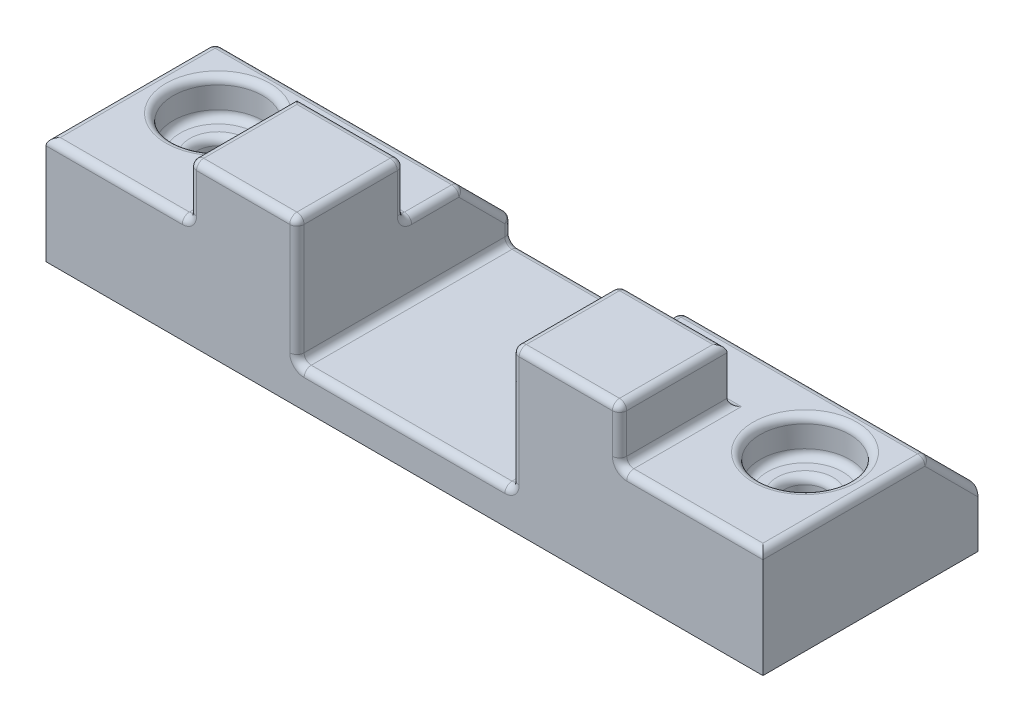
ISO-10303-21;
HEADER;
FILE_DESCRIPTION(('STEP AP214'),'2;1');
FILE_NAME('part.step','',(''),(''),'','','');
FILE_SCHEMA(('AUTOMOTIVE_DESIGN { 1 0 10303 214 1 1 1 1 }'));
ENDSEC;
DATA;
#1=APPLICATION_CONTEXT('core data for automotive mechanical design processes');
#2=APPLICATION_PROTOCOL_DEFINITION('international standard','automotive_design',2000,#1);
#3=PRODUCT_CONTEXT('',#1,'mechanical');
#4=PRODUCT('Part','Part','',(#3));
#5=PRODUCT_RELATED_PRODUCT_CATEGORY('part','',(#4));
#6=PRODUCT_DEFINITION_FORMATION('','',#4);
#7=PRODUCT_DEFINITION_CONTEXT('part definition',#1,'design');
#8=PRODUCT_DEFINITION('design','',#6,#7);
#9=PRODUCT_DEFINITION_SHAPE('','',#8);
#10=(LENGTH_UNIT() NAMED_UNIT(*) SI_UNIT(.MILLI.,.METRE.));
#11=(NAMED_UNIT(*) PLANE_ANGLE_UNIT() SI_UNIT($,.RADIAN.));
#12=(NAMED_UNIT(*) SI_UNIT($,.STERADIAN.) SOLID_ANGLE_UNIT());
#13=UNCERTAINTY_MEASURE_WITH_UNIT(LENGTH_MEASURE(1.E-05),#10,'distance_accuracy_value','');
#14=(GEOMETRIC_REPRESENTATION_CONTEXT(3) GLOBAL_UNCERTAINTY_ASSIGNED_CONTEXT((#13)) GLOBAL_UNIT_ASSIGNED_CONTEXT((#10,
#11,#12)) REPRESENTATION_CONTEXT('',''));
#15=CARTESIAN_POINT('',(0.,0.,0.));
#16=DIRECTION('',(0.,0.,1.));
#17=DIRECTION('',(1.,0.,0.));
#18=AXIS2_PLACEMENT_3D('',#15,#16,#17);
#19=CARTESIAN_POINT('',(0.,0.,60.));
#20=DIRECTION('',(0.,-1.,0.));
#21=DIRECTION('',(0.,0.,-1.));
#22=AXIS2_PLACEMENT_3D('',#19,#20,#21);
#23=PLANE('',#22);
#24=DIRECTION('',(0.,0.,1.));
#25=VECTOR('',#24,1.);
#26=CARTESIAN_POINT('',(38.,0.,30.));
#27=LINE('',#26,#25);
#28=CARTESIAN_POINT('',(38.,0.,58.));
#29=VERTEX_POINT('',#28);
#30=CARTESIAN_POINT('',(38.,0.,28.));
#31=VERTEX_POINT('',#30);
#32=EDGE_CURVE('E560',#29,#31,#27,.F.);
#33=ORIENTED_EDGE('',*,*,#32,.T.);
#34=DIRECTION('',(-1.,0.,0.));
#35=VECTOR('',#34,1.);
#36=CARTESIAN_POINT('',(70.,0.,28.));
#37=LINE('',#36,#35);
#38=CARTESIAN_POINT('',(68.,0.,28.));
#39=VERTEX_POINT('',#38);
#40=EDGE_CURVE('E562',#31,#39,#37,.F.);
#41=ORIENTED_EDGE('',*,*,#40,.T.);
#42=DIRECTION('',(0.,0.,1.));
#43=VECTOR('',#42,1.);
#44=CARTESIAN_POINT('',(68.,0.,60.));
#45=LINE('',#44,#43);
#46=CARTESIAN_POINT('',(68.,0.,14.8284271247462));
#47=VERTEX_POINT('',#46);
#48=EDGE_CURVE('E552',#39,#47,#45,.F.);
#49=ORIENTED_EDGE('',*,*,#48,.T.);
#50=DIRECTION('',(1.,0.,0.));
#51=VECTOR('',#50,1.);
#52=CARTESIAN_POINT('',(0.,0.,14.8284271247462));
#53=LINE('',#52,#51);
#54=CARTESIAN_POINT('',(2.,0.,14.8284271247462));
#55=VERTEX_POINT('',#54);
#56=EDGE_CURVE('E554',#47,#55,#53,.F.);
#57=ORIENTED_EDGE('',*,*,#56,.T.);
#58=DIRECTION('',(0.,0.,-1.));
#59=VECTOR('',#58,1.);
#60=CARTESIAN_POINT('',(2.,0.,60.));
#61=LINE('',#60,#59);
#62=CARTESIAN_POINT('',(2.,0.,58.));
#63=VERTEX_POINT('',#62);
#64=EDGE_CURVE('E556',#55,#63,#61,.F.);
#65=ORIENTED_EDGE('',*,*,#64,.T.);
#66=DIRECTION('',(-1.,0.,0.));
#67=VECTOR('',#66,1.);
#68=CARTESIAN_POINT('',(40.,0.,58.));
#69=LINE('',#68,#67);
#70=EDGE_CURVE('E558',#63,#29,#69,.F.);
#71=ORIENTED_EDGE('',*,*,#70,.T.);
#72=EDGE_LOOP('',(#33,#41,#49,#57,#65,#71));
#73=FACE_BOUND('',#72,.T.);
#74=CARTESIAN_POINT('',(18.1208053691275,0.,30.1403693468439));
#75=DIRECTION('',(0.,-1.,0.));
#76=DIRECTION('',(0.,0.,-1.));
#77=AXIS2_PLACEMENT_3D('',#74,#75,#76);
#78=CIRCLE('',#77,14.5);
#79=CARTESIAN_POINT('',(18.1208053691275,0.,15.6403693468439));
#80=VERTEX_POINT('',#79);
#81=EDGE_CURVE('E380',#80,#80,#78,.T.);
#82=ORIENTED_EDGE('',*,*,#81,.T.);
#83=EDGE_LOOP('',(#82));
#84=FACE_BOUND('',#83,.T.);
#85=ADVANCED_FACE('F47',(#73,#84),#23,.F.);
#86=DIRECTION('',(0.,0.,-1.));
#87=VECTOR('',#86,1.);
#88=CARTESIAN_POINT('',(162.,0.,60.));
#89=LINE('',#88,#87);
#90=CARTESIAN_POINT('',(162.,0.,28.));
#91=VERTEX_POINT('',#90);
#92=CARTESIAN_POINT('',(162.,0.,58.));
#93=VERTEX_POINT('',#92);
#94=EDGE_CURVE('E62',#91,#93,#89,.F.);
#95=ORIENTED_EDGE('',*,*,#94,.T.);
#96=DIRECTION('',(-1.,0.,0.));
#97=VECTOR('',#96,1.);
#98=CARTESIAN_POINT('',(200.,0.,58.));
#99=LINE('',#98,#97);
#100=CARTESIAN_POINT('',(198.,0.,58.));
#101=VERTEX_POINT('',#100);
#102=EDGE_CURVE('E591',#93,#101,#99,.F.);
#103=ORIENTED_EDGE('',*,*,#102,.T.);
#104=DIRECTION('',(0.,0.,-1.));
#105=VECTOR('',#104,1.);
#106=CARTESIAN_POINT('',(198.,0.,60.));
#107=LINE('',#106,#105);
#108=CARTESIAN_POINT('',(198.,0.,14.8284271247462));
#109=VERTEX_POINT('',#108);
#110=EDGE_CURVE('E583',#101,#109,#107,.T.);
#111=ORIENTED_EDGE('',*,*,#110,.T.);
#112=DIRECTION('',(1.,0.,0.));
#113=VECTOR('',#112,1.);
#114=CARTESIAN_POINT('',(130.,0.,14.8284271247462));
#115=LINE('',#114,#113);
#116=CARTESIAN_POINT('',(132.,0.,14.8284271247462));
#117=VERTEX_POINT('',#116);
#118=EDGE_CURVE('E585',#109,#117,#115,.F.);
#119=ORIENTED_EDGE('',*,*,#118,.T.);
#120=DIRECTION('',(0.,0.,-1.));
#121=VECTOR('',#120,1.);
#122=CARTESIAN_POINT('',(132.,0.,59.9999999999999));
#123=LINE('',#122,#121);
#124=CARTESIAN_POINT('',(132.,0.,28.));
#125=VERTEX_POINT('',#124);
#126=EDGE_CURVE('E587',#117,#125,#123,.F.);
#127=ORIENTED_EDGE('',*,*,#126,.T.);
#128=DIRECTION('',(-1.,0.,0.));
#129=VECTOR('',#128,1.);
#130=CARTESIAN_POINT('',(160.,0.,28.));
#131=LINE('',#130,#129);
#132=EDGE_CURVE('E67',#125,#91,#131,.F.);
#133=ORIENTED_EDGE('',*,*,#132,.T.);
#134=EDGE_LOOP('',(#95,#103,#111,#119,#127,#133));
#135=FACE_BOUND('',#134,.T.);
#136=CARTESIAN_POINT('',(181.879194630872,0.,30.1403693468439));
#137=DIRECTION('',(0.,-1.,0.));
#138=DIRECTION('',(0.,0.,-1.));
#139=AXIS2_PLACEMENT_3D('',#136,#137,#138);
#140=CIRCLE('',#139,14.5);
#141=CARTESIAN_POINT('',(181.879194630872,0.,15.6403693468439));
#142=VERTEX_POINT('',#141);
#143=EDGE_CURVE('E398',#142,#142,#140,.T.);
#144=ORIENTED_EDGE('',*,*,#143,.T.);
#145=EDGE_LOOP('',(#144));
#146=FACE_BOUND('',#145,.T.);
#147=ADVANCED_FACE('F817',(#135,#146),#23,.F.);
#148=CARTESIAN_POINT('',(0.,0.,60.));
#149=DIRECTION('',(1.,0.,0.));
#150=DIRECTION('',(0.,1.,0.));
#151=AXIS2_PLACEMENT_3D('',#148,#149,#150);
#152=PLANE('',#151);
#153=DIRECTION('',(0.,0.,-1.));
#154=VECTOR('',#153,1.);
#155=CARTESIAN_POINT('',(0.,-2.,60.));
#156=LINE('',#155,#154);
#157=CARTESIAN_POINT('',(0.,-2.,60.));
#158=VERTEX_POINT('',#157);
#159=CARTESIAN_POINT('',(0.,-2.,14.8284271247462));
#160=VERTEX_POINT('',#159);
#161=EDGE_CURVE('E539',#158,#160,#156,.T.);
#162=ORIENTED_EDGE('',*,*,#161,.T.);
#163=DIRECTION('',(0.,0.707106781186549,0.707106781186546));
#164=VECTOR('',#163,1.);
#165=CARTESIAN_POINT('',(0.,-15.4142135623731,1.41421356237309));
#166=LINE('',#165,#164);
#167=CARTESIAN_POINT('',(0.,-16.8284271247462,0.));
#168=VERTEX_POINT('',#167);
#169=EDGE_CURVE('E541',#160,#168,#166,.F.);
#170=ORIENTED_EDGE('',*,*,#169,.T.);
#171=DIRECTION('',(0.,-1.,0.));
#172=VECTOR('',#171,1.);
#173=CARTESIAN_POINT('',(0.,0.,0.));
#174=LINE('',#173,#172);
#175=CARTESIAN_POINT('',(0.,-30.,0.));
#176=VERTEX_POINT('',#175);
#177=EDGE_CURVE('E359',#168,#176,#174,.T.);
#178=ORIENTED_EDGE('',*,*,#177,.T.);
#179=DIRECTION('',(0.,0.,-1.));
#180=VECTOR('',#179,1.);
#181=CARTESIAN_POINT('',(0.,-30.,60.));
#182=LINE('',#181,#180);
#183=CARTESIAN_POINT('',(0.,-30.,60.));
#184=VERTEX_POINT('',#183);
#185=EDGE_CURVE('E350',#184,#176,#182,.T.);
#186=ORIENTED_EDGE('',*,*,#185,.F.);
#187=DIRECTION('',(0.,-1.,0.));
#188=VECTOR('',#187,1.);
#189=CARTESIAN_POINT('',(0.,0.,60.));
#190=LINE('',#189,#188);
#191=EDGE_CURVE('E334',#158,#184,#190,.T.);
#192=ORIENTED_EDGE('',*,*,#191,.F.);
#193=EDGE_LOOP('',(#162,#170,#178,#186,#192));
#194=FACE_BOUND('',#193,.T.);
#195=ADVANCED_FACE('F357',(#194),#152,.F.);
#196=CARTESIAN_POINT('',(0.,-30.,60.));
#197=DIRECTION('',(0.,1.,0.));
#198=DIRECTION('',(0.,0.,1.));
#199=AXIS2_PLACEMENT_3D('',#196,#197,#198);
#200=PLANE('',#199);
#201=CARTESIAN_POINT('',(18.1208053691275,-30.,30.1403693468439));
#202=DIRECTION('',(0.,1.,0.));
#203=DIRECTION('',(0.,0.,1.));
#204=AXIS2_PLACEMENT_3D('',#201,#202,#203);
#205=CIRCLE('',#204,7.8341009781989);
#206=CARTESIAN_POINT('',(18.1208053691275,-30.,37.9744703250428));
#207=VERTEX_POINT('',#206);
#208=EDGE_CURVE('E791',#207,#207,#205,.T.);
#209=ORIENTED_EDGE('',*,*,#208,.T.);
#210=EDGE_LOOP('',(#209));
#211=FACE_BOUND('',#210,.T.);
#212=CARTESIAN_POINT('',(181.879194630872,-30.,30.1403693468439));
#213=DIRECTION('',(0.,1.,0.));
#214=DIRECTION('',(0.,0.,1.));
#215=AXIS2_PLACEMENT_3D('',#212,#213,#214);
#216=CIRCLE('',#215,7.8341009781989);
#217=CARTESIAN_POINT('',(181.879194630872,-30.,37.9744703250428));
#218=VERTEX_POINT('',#217);
#219=EDGE_CURVE('E593',#218,#218,#216,.T.);
#220=ORIENTED_EDGE('',*,*,#219,.T.);
#221=EDGE_LOOP('',(#220));
#222=FACE_BOUND('',#221,.T.);
#223=DIRECTION('',(1.,0.,0.));
#224=VECTOR('',#223,1.);
#225=CARTESIAN_POINT('',(0.,-30.,0.));
#226=LINE('',#225,#224);
#227=CARTESIAN_POINT('',(200.,-30.,0.));
#228=VERTEX_POINT('',#227);
#229=EDGE_CURVE('E1124',#176,#228,#226,.T.);
#230=ORIENTED_EDGE('',*,*,#229,.T.);
#231=DIRECTION('',(0.,0.,-1.));
#232=VECTOR('',#231,1.);
#233=CARTESIAN_POINT('',(200.,-30.,60.));
#234=LINE('',#233,#232);
#235=CARTESIAN_POINT('',(200.,-30.,60.));
#236=VERTEX_POINT('',#235);
#237=EDGE_CURVE('E352',#236,#228,#234,.T.);
#238=ORIENTED_EDGE('',*,*,#237,.F.);
#239=DIRECTION('',(1.,0.,0.));
#240=VECTOR('',#239,1.);
#241=CARTESIAN_POINT('',(0.,-30.,60.));
#242=LINE('',#241,#240);
#243=EDGE_CURVE('E338',#184,#236,#242,.T.);
#244=ORIENTED_EDGE('',*,*,#243,.F.);
#245=ORIENTED_EDGE('',*,*,#185,.T.);
#246=EDGE_LOOP('',(#230,#238,#244,#245));
#247=FACE_BOUND('',#246,.T.);
#248=ADVANCED_FACE('F349',(#211,#222,#247),#200,.F.);
#249=CARTESIAN_POINT('',(200.,0.,60.));
#250=DIRECTION('',(-1.,0.,0.));
#251=DIRECTION('',(0.,0.,1.));
#252=AXIS2_PLACEMENT_3D('',#249,#250,#251);
#253=PLANE('',#252);
#254=DIRECTION('',(0.,1.,0.));
#255=VECTOR('',#254,1.);
#256=CARTESIAN_POINT('',(200.,0.,0.));
#257=LINE('',#256,#255);
#258=CARTESIAN_POINT('',(200.,-16.8284271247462,0.));
#259=VERTEX_POINT('',#258);
#260=EDGE_CURVE('E345',#228,#259,#257,.T.);
#261=ORIENTED_EDGE('',*,*,#260,.T.);
#262=DIRECTION('',(0.,-0.707106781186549,-0.707106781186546));
#263=VECTOR('',#262,1.);
#264=CARTESIAN_POINT('',(200.,-1.41421356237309,15.4142135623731));
#265=LINE('',#264,#263);
#266=CARTESIAN_POINT('',(200.,-2.,14.8284271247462));
#267=VERTEX_POINT('',#266);
#268=EDGE_CURVE('E527',#259,#267,#265,.F.);
#269=ORIENTED_EDGE('',*,*,#268,.T.);
#270=DIRECTION('',(0.,0.,-1.));
#271=VECTOR('',#270,1.);
#272=CARTESIAN_POINT('',(200.,-2.,60.));
#273=LINE('',#272,#271);
#274=CARTESIAN_POINT('',(200.,-2.,60.));
#275=VERTEX_POINT('',#274);
#276=EDGE_CURVE('E525',#267,#275,#273,.F.);
#277=ORIENTED_EDGE('',*,*,#276,.T.);
#278=DIRECTION('',(0.,1.,0.));
#279=VECTOR('',#278,1.);
#280=CARTESIAN_POINT('',(200.,0.,60.));
#281=LINE('',#280,#279);
#282=EDGE_CURVE('E355',#236,#275,#281,.T.);
#283=ORIENTED_EDGE('',*,*,#282,.F.);
#284=ORIENTED_EDGE('',*,*,#237,.T.);
#285=EDGE_LOOP('',(#261,#269,#277,#283,#284));
#286=FACE_BOUND('',#285,.T.);
#287=ADVANCED_FACE('F807',(#286),#253,.F.);
#288=CARTESIAN_POINT('',(0.,-30.,60.));
#289=DIRECTION('',(0.,0.,1.));
#290=DIRECTION('',(1.,0.,0.));
#291=AXIS2_PLACEMENT_3D('',#288,#289,#290);
#292=PLANE('',#291);
#293=CARTESIAN_POINT('',(38.,2.,60.));
#294=DIRECTION('',(0.,0.,1.));
#295=DIRECTION('',(1.,0.,0.));
#296=AXIS2_PLACEMENT_3D('',#293,#294,#295);
#297=CIRCLE('',#296,4.);
#298=CARTESIAN_POINT('',(38.,-2.,60.));
#299=VERTEX_POINT('',#298);
#300=CARTESIAN_POINT('',(42.,2.,60.));
#301=VERTEX_POINT('',#300);
#302=EDGE_CURVE('E429',#299,#301,#297,.T.);
#303=ORIENTED_EDGE('',*,*,#302,.F.);
#304=DIRECTION('',(-1.,0.,0.));
#305=VECTOR('',#304,1.);
#306=CARTESIAN_POINT('',(0.,-2.,60.));
#307=LINE('',#306,#305);
#308=EDGE_CURVE('E341',#299,#158,#307,.T.);
#309=ORIENTED_EDGE('',*,*,#308,.T.);
#310=ORIENTED_EDGE('',*,*,#191,.T.);
#311=ORIENTED_EDGE('',*,*,#243,.T.);
#312=ORIENTED_EDGE('',*,*,#282,.T.);
#313=DIRECTION('',(-1.,0.,0.));
#314=VECTOR('',#313,1.);
#315=CARTESIAN_POINT('',(160.,-2.,60.));
#316=LINE('',#315,#314);
#317=CARTESIAN_POINT('',(162.,-2.,60.));
#318=VERTEX_POINT('',#317);
#319=EDGE_CURVE('E404',#275,#318,#316,.T.);
#320=ORIENTED_EDGE('',*,*,#319,.T.);
#321=CARTESIAN_POINT('',(162.,2.,60.));
#322=DIRECTION('',(0.,0.,1.));
#323=DIRECTION('',(1.,0.,0.));
#324=AXIS2_PLACEMENT_3D('',#321,#322,#323);
#325=CIRCLE('',#324,4.);
#326=CARTESIAN_POINT('',(158.,2.,60.));
#327=VERTEX_POINT('',#326);
#328=EDGE_CURVE('E401',#327,#318,#325,.T.);
#329=ORIENTED_EDGE('',*,*,#328,.F.);
#330=DIRECTION('',(0.,-1.,0.));
#331=VECTOR('',#330,1.);
#332=CARTESIAN_POINT('',(158.,15.,60.));
#333=LINE('',#332,#331);
#334=CARTESIAN_POINT('',(158.,13.,60.));
#335=VERTEX_POINT('',#334);
#336=EDGE_CURVE('E406',#327,#335,#333,.F.);
#337=ORIENTED_EDGE('',*,*,#336,.T.);
#338=DIRECTION('',(1.,0.,0.));
#339=VECTOR('',#338,1.);
#340=CARTESIAN_POINT('',(130.,13.,60.));
#341=LINE('',#340,#339);
#342=CARTESIAN_POINT('',(132.,13.,60.));
#343=VERTEX_POINT('',#342);
#344=EDGE_CURVE('E408',#335,#343,#341,.F.);
#345=ORIENTED_EDGE('',*,*,#344,.T.);
#346=DIRECTION('',(0.,1.,0.));
#347=VECTOR('',#346,1.);
#348=CARTESIAN_POINT('',(132.,-20.,60.));
#349=LINE('',#348,#347);
#350=CARTESIAN_POINT('',(132.,-18.,60.));
#351=VERTEX_POINT('',#350);
#352=EDGE_CURVE('E410',#343,#351,#349,.F.);
#353=ORIENTED_EDGE('',*,*,#352,.T.);
#354=CARTESIAN_POINT('',(128.,-18.,60.));
#355=DIRECTION('',(0.,0.,1.));
#356=DIRECTION('',(1.,0.,0.));
#357=AXIS2_PLACEMENT_3D('',#354,#355,#356);
#358=CIRCLE('',#357,4.);
#359=CARTESIAN_POINT('',(128.,-22.,60.));
#360=VERTEX_POINT('',#359);
#361=EDGE_CURVE('E412',#360,#351,#358,.T.);
#362=ORIENTED_EDGE('',*,*,#361,.F.);
#363=DIRECTION('',(1.,0.,0.));
#364=VECTOR('',#363,1.);
#365=CARTESIAN_POINT('',(70.,-22.,60.));
#366=LINE('',#365,#364);
#367=CARTESIAN_POINT('',(72.,-22.,60.));
#368=VERTEX_POINT('',#367);
#369=EDGE_CURVE('E415',#360,#368,#366,.F.);
#370=ORIENTED_EDGE('',*,*,#369,.T.);
#371=CARTESIAN_POINT('',(72.,-18.,60.));
#372=DIRECTION('',(0.,0.,1.));
#373=DIRECTION('',(1.,0.,0.));
#374=AXIS2_PLACEMENT_3D('',#371,#372,#373);
#375=CIRCLE('',#374,4.);
#376=CARTESIAN_POINT('',(68.,-18.,60.));
#377=VERTEX_POINT('',#376);
#378=EDGE_CURVE('E418',#377,#368,#375,.T.);
#379=ORIENTED_EDGE('',*,*,#378,.F.);
#380=DIRECTION('',(0.,1.,0.));
#381=VECTOR('',#380,1.);
#382=CARTESIAN_POINT('',(68.,15.,60.));
#383=LINE('',#382,#381);
#384=CARTESIAN_POINT('',(68.,13.,60.));
#385=VERTEX_POINT('',#384);
#386=EDGE_CURVE('E421',#377,#385,#383,.T.);
#387=ORIENTED_EDGE('',*,*,#386,.T.);
#388=DIRECTION('',(1.,0.,0.));
#389=VECTOR('',#388,1.);
#390=CARTESIAN_POINT('',(0.,13.,60.));
#391=LINE('',#390,#389);
#392=CARTESIAN_POINT('',(42.,13.,60.));
#393=VERTEX_POINT('',#392);
#394=EDGE_CURVE('E425',#385,#393,#391,.F.);
#395=ORIENTED_EDGE('',*,*,#394,.T.);
#396=DIRECTION('',(0.,-1.,0.));
#397=VECTOR('',#396,1.);
#398=CARTESIAN_POINT('',(42.,0.,60.));
#399=LINE('',#398,#397);
#400=EDGE_CURVE('E427',#393,#301,#399,.T.);
#401=ORIENTED_EDGE('',*,*,#400,.T.);
#402=EDGE_LOOP('',(#303,#309,#310,#311,#312,#320,#329,#337,#345,#353,#362,#370,#379,#387,#395,#401));
#403=FACE_BOUND('',#402,.T.);
#404=ADVANCED_FACE('F336',(#403),#292,.T.);
#405=CARTESIAN_POINT('',(0.,-30.,0.));
#406=DIRECTION('',(0.,0.,1.));
#407=DIRECTION('',(1.,0.,0.));
#408=AXIS2_PLACEMENT_3D('',#405,#406,#407);
#409=PLANE('',#408);
#410=DIRECTION('',(-1.,0.,0.));
#411=VECTOR('',#410,1.);
#412=CARTESIAN_POINT('',(200.,-14.8284271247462,0.));
#413=LINE('',#412,#411);
#414=CARTESIAN_POINT('',(132.,-14.8284271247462,0.));
#415=VERTEX_POINT('',#414);
#416=CARTESIAN_POINT('',(199.414213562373,-14.8284271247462,0.));
#417=VERTEX_POINT('',#416);
#418=EDGE_CURVE('E486',#415,#417,#413,.F.);
#419=ORIENTED_EDGE('',*,*,#418,.T.);
#420=CARTESIAN_POINT('',(198.,-16.8284271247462,0.));
#421=DIRECTION('',(0.,0.,1.));
#422=DIRECTION('',(0.,1.,0.));
#423=AXIS2_PLACEMENT_3D('',#420,#421,#422);
#424=ELLIPSE('',#423,2.82842712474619,2.);
#425=EDGE_CURVE('E488',#417,#259,#424,.F.);
#426=ORIENTED_EDGE('',*,*,#425,.T.);
#427=ORIENTED_EDGE('',*,*,#260,.F.);
#428=ORIENTED_EDGE('',*,*,#229,.F.);
#429=ORIENTED_EDGE('',*,*,#177,.F.);
#430=CARTESIAN_POINT('',(2.,-16.8284271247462,0.));
#431=DIRECTION('',(0.,0.,1.));
#432=DIRECTION('',(0.,-1.,0.));
#433=AXIS2_PLACEMENT_3D('',#430,#431,#432);
#434=ELLIPSE('',#433,2.82842712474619,2.);
#435=CARTESIAN_POINT('',(0.585786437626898,-14.8284271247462,0.));
#436=VERTEX_POINT('',#435);
#437=EDGE_CURVE('E472',#168,#436,#434,.F.);
#438=ORIENTED_EDGE('',*,*,#437,.T.);
#439=DIRECTION('',(-1.,0.,0.));
#440=VECTOR('',#439,1.);
#441=CARTESIAN_POINT('',(70.,-14.8284271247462,0.));
#442=LINE('',#441,#440);
#443=CARTESIAN_POINT('',(68.,-14.8284271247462,0.));
#444=VERTEX_POINT('',#443);
#445=EDGE_CURVE('E470',#436,#444,#442,.F.);
#446=ORIENTED_EDGE('',*,*,#445,.T.);
#447=DIRECTION('',(0.,1.,0.));
#448=VECTOR('',#447,1.);
#449=CARTESIAN_POINT('',(68.,-30.,0.));
#450=LINE('',#449,#448);
#451=CARTESIAN_POINT('',(68.,-18.,0.));
#452=VERTEX_POINT('',#451);
#453=EDGE_CURVE('E474',#444,#452,#450,.F.);
#454=ORIENTED_EDGE('',*,*,#453,.T.);
#455=CARTESIAN_POINT('',(72.,-18.,0.));
#456=DIRECTION('',(0.,0.,1.));
#457=DIRECTION('',(1.,0.,0.));
#458=AXIS2_PLACEMENT_3D('',#455,#456,#457);
#459=CIRCLE('',#458,4.);
#460=CARTESIAN_POINT('',(72.,-22.,0.));
#461=VERTEX_POINT('',#460);
#462=EDGE_CURVE('E476',#461,#452,#459,.F.);
#463=ORIENTED_EDGE('',*,*,#462,.F.);
#464=DIRECTION('',(-1.,0.,0.));
#465=VECTOR('',#464,1.);
#466=CARTESIAN_POINT('',(0.,-22.,0.));
#467=LINE('',#466,#465);
#468=CARTESIAN_POINT('',(128.,-22.,0.));
#469=VERTEX_POINT('',#468);
#470=EDGE_CURVE('E479',#461,#469,#467,.F.);
#471=ORIENTED_EDGE('',*,*,#470,.T.);
#472=CARTESIAN_POINT('',(128.,-18.,0.));
#473=DIRECTION('',(0.,0.,1.));
#474=DIRECTION('',(1.,0.,0.));
#475=AXIS2_PLACEMENT_3D('',#472,#473,#474);
#476=CIRCLE('',#475,4.);
#477=CARTESIAN_POINT('',(132.,-18.,0.));
#478=VERTEX_POINT('',#477);
#479=EDGE_CURVE('E481',#478,#469,#476,.F.);
#480=ORIENTED_EDGE('',*,*,#479,.F.);
#481=DIRECTION('',(0.,1.,0.));
#482=VECTOR('',#481,1.);
#483=CARTESIAN_POINT('',(132.,-30.,0.));
#484=LINE('',#483,#482);
#485=EDGE_CURVE('E484',#478,#415,#484,.T.);
#486=ORIENTED_EDGE('',*,*,#485,.T.);
#487=EDGE_LOOP('',(#419,#426,#427,#428,#429,#438,#446,#454,#463,#471,#480,#486));
#488=FACE_BOUND('',#487,.T.);
#489=ADVANCED_FACE('F826',(#488),#409,.F.);
#490=CARTESIAN_POINT('',(130.,-20.,60.));
#491=DIRECTION('',(1.,0.,0.));
#492=DIRECTION('',(0.,0.,-1.));
#493=AXIS2_PLACEMENT_3D('',#490,#491,#492);
#494=PLANE('',#493);
#495=DIRECTION('',(0.,0.,-1.));
#496=VECTOR('',#495,1.);
#497=CARTESIAN_POINT('',(130.,-18.,60.));
#498=LINE('',#497,#496);
#499=CARTESIAN_POINT('',(130.,-18.,2.));
#500=VERTEX_POINT('',#499);
#501=CARTESIAN_POINT('',(130.,-18.,58.));
#502=VERTEX_POINT('',#501);
#503=EDGE_CURVE('E465',#500,#502,#498,.F.);
#504=ORIENTED_EDGE('',*,*,#503,.T.);
#505=DIRECTION('',(0.,1.,0.));
#506=VECTOR('',#505,1.);
#507=CARTESIAN_POINT('',(130.,15.,58.));
#508=LINE('',#507,#506);
#509=CARTESIAN_POINT('',(130.,13.,58.));
#510=VERTEX_POINT('',#509);
#511=EDGE_CURVE('E467',#502,#510,#508,.T.);
#512=ORIENTED_EDGE('',*,*,#511,.T.);
#513=DIRECTION('',(0.,0.,1.));
#514=VECTOR('',#513,1.);
#515=CARTESIAN_POINT('',(130.,13.,60.));
#516=LINE('',#515,#514);
#517=CARTESIAN_POINT('',(130.,13.,32.));
#518=VERTEX_POINT('',#517);
#519=EDGE_CURVE('E463',#510,#518,#516,.F.);
#520=ORIENTED_EDGE('',*,*,#519,.T.);
#521=DIRECTION('',(0.,-1.,0.));
#522=VECTOR('',#521,1.);
#523=CARTESIAN_POINT('',(130.,-20.,32.));
#524=LINE('',#523,#522);
#525=CARTESIAN_POINT('',(130.,2.,32.));
#526=VERTEX_POINT('',#525);
#527=EDGE_CURVE('E459',#518,#526,#524,.T.);
#528=ORIENTED_EDGE('',*,*,#527,.T.);
#529=CARTESIAN_POINT('',(130.,2.,28.));
#530=DIRECTION('',(1.,0.,0.));
#531=DIRECTION('',(0.,0.,-1.));
#532=AXIS2_PLACEMENT_3D('',#529,#530,#531);
#533=CIRCLE('',#532,4.);
#534=CARTESIAN_POINT('',(130.,-2.,28.));
#535=VERTEX_POINT('',#534);
#536=EDGE_CURVE('E456',#535,#526,#533,.F.);
#537=ORIENTED_EDGE('',*,*,#536,.F.);
#538=DIRECTION('',(0.,0.,-1.));
#539=VECTOR('',#538,1.);
#540=CARTESIAN_POINT('',(130.,-2.,60.));
#541=LINE('',#540,#539);
#542=CARTESIAN_POINT('',(130.,-2.,14.8284271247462));
#543=VERTEX_POINT('',#542);
#544=EDGE_CURVE('E452',#535,#543,#541,.T.);
#545=ORIENTED_EDGE('',*,*,#544,.T.);
#546=DIRECTION('',(0.,0.707106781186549,0.707106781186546));
#547=VECTOR('',#546,1.);
#548=CARTESIAN_POINT('',(130.,-15.4142135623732,1.41421356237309));
#549=LINE('',#548,#547);
#550=CARTESIAN_POINT('',(130.,-14.8284271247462,2.));
#551=VERTEX_POINT('',#550);
#552=EDGE_CURVE('E454',#543,#551,#549,.F.);
#553=ORIENTED_EDGE('',*,*,#552,.T.);
#554=DIRECTION('',(0.,1.,0.));
#555=VECTOR('',#554,1.);
#556=CARTESIAN_POINT('',(130.,-20.,2.));
#557=LINE('',#556,#555);
#558=EDGE_CURVE('E461',#551,#500,#557,.F.);
#559=ORIENTED_EDGE('',*,*,#558,.T.);
#560=EDGE_LOOP('',(#504,#512,#520,#528,#537,#545,#553,#559));
#561=FACE_BOUND('',#560,.T.);
#562=ADVANCED_FACE('F1146',(#561),#494,.F.);
#563=CARTESIAN_POINT('',(70.,-20.,60.));
#564=DIRECTION('',(-1.,0.,0.));
#565=DIRECTION('',(0.,0.,1.));
#566=AXIS2_PLACEMENT_3D('',#563,#564,#565);
#567=PLANE('',#566);
#568=DIRECTION('',(0.,0.,1.));
#569=VECTOR('',#568,1.);
#570=CARTESIAN_POINT('',(70.,-18.,0.));
#571=LINE('',#570,#569);
#572=CARTESIAN_POINT('',(70.,-18.,58.));
#573=VERTEX_POINT('',#572);
#574=CARTESIAN_POINT('',(70.,-18.,2.));
#575=VERTEX_POINT('',#574);
#576=EDGE_CURVE('E448',#573,#575,#571,.F.);
#577=ORIENTED_EDGE('',*,*,#576,.T.);
#578=DIRECTION('',(0.,1.,0.));
#579=VECTOR('',#578,1.);
#580=CARTESIAN_POINT('',(70.,-20.,2.));
#581=LINE('',#580,#579);
#582=CARTESIAN_POINT('',(70.,-14.8284271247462,2.));
#583=VERTEX_POINT('',#582);
#584=EDGE_CURVE('E450',#575,#583,#581,.T.);
#585=ORIENTED_EDGE('',*,*,#584,.T.);
#586=DIRECTION('',(0.,-0.707106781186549,-0.707106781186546));
#587=VECTOR('',#586,1.);
#588=CARTESIAN_POINT('',(70.,-1.41421356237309,15.4142135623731));
#589=LINE('',#588,#587);
#590=CARTESIAN_POINT('',(70.,-2.,14.8284271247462));
#591=VERTEX_POINT('',#590);
#592=EDGE_CURVE('E446',#583,#591,#589,.F.);
#593=ORIENTED_EDGE('',*,*,#592,.T.);
#594=DIRECTION('',(0.,0.,1.));
#595=VECTOR('',#594,1.);
#596=CARTESIAN_POINT('',(70.,-2.,60.));
#597=LINE('',#596,#595);
#598=CARTESIAN_POINT('',(70.,-2.,28.));
#599=VERTEX_POINT('',#598);
#600=EDGE_CURVE('E444',#591,#599,#597,.T.);
#601=ORIENTED_EDGE('',*,*,#600,.T.);
#602=CARTESIAN_POINT('',(70.,2.,28.));
#603=DIRECTION('',(-1.,0.,0.));
#604=DIRECTION('',(0.,0.,1.));
#605=AXIS2_PLACEMENT_3D('',#602,#603,#604);
#606=CIRCLE('',#605,4.);
#607=CARTESIAN_POINT('',(70.,2.,32.));
#608=VERTEX_POINT('',#607);
#609=EDGE_CURVE('E441',#608,#599,#606,.F.);
#610=ORIENTED_EDGE('',*,*,#609,.F.);
#611=DIRECTION('',(0.,-1.,0.));
#612=VECTOR('',#611,1.);
#613=CARTESIAN_POINT('',(70.,-20.,32.));
#614=LINE('',#613,#612);
#615=CARTESIAN_POINT('',(70.,13.,32.));
#616=VERTEX_POINT('',#615);
#617=EDGE_CURVE('E435',#608,#616,#614,.F.);
#618=ORIENTED_EDGE('',*,*,#617,.T.);
#619=DIRECTION('',(0.,0.,-1.));
#620=VECTOR('',#619,1.);
#621=CARTESIAN_POINT('',(70.,13.,60.));
#622=LINE('',#621,#620);
#623=CARTESIAN_POINT('',(70.,13.,58.));
#624=VERTEX_POINT('',#623);
#625=EDGE_CURVE('E433',#616,#624,#622,.F.);
#626=ORIENTED_EDGE('',*,*,#625,.T.);
#627=DIRECTION('',(0.,1.,0.));
#628=VECTOR('',#627,1.);
#629=CARTESIAN_POINT('',(70.,-20.,58.));
#630=LINE('',#629,#628);
#631=EDGE_CURVE('E437',#624,#573,#630,.F.);
#632=ORIENTED_EDGE('',*,*,#631,.T.);
#633=EDGE_LOOP('',(#577,#585,#593,#601,#610,#618,#626,#632));
#634=FACE_BOUND('',#633,.T.);
#635=ADVANCED_FACE('F1248',(#634),#567,.F.);
#636=CARTESIAN_POINT('',(130.,-20.,0.));
#637=DIRECTION('',(0.,-1.,0.));
#638=DIRECTION('',(0.,0.,-1.));
#639=AXIS2_PLACEMENT_3D('',#636,#637,#638);
#640=PLANE('',#639);
#641=DIRECTION('',(0.,0.,1.));
#642=VECTOR('',#641,1.);
#643=CARTESIAN_POINT('',(72.,-20.,60.));
#644=LINE('',#643,#642);
#645=CARTESIAN_POINT('',(72.,-20.,2.));
#646=VERTEX_POINT('',#645);
#647=CARTESIAN_POINT('',(72.,-20.,58.));
#648=VERTEX_POINT('',#647);
#649=EDGE_CURVE('E533',#646,#648,#644,.T.);
#650=ORIENTED_EDGE('',*,*,#649,.T.);
#651=DIRECTION('',(1.,0.,0.));
#652=VECTOR('',#651,1.);
#653=CARTESIAN_POINT('',(130.,-20.,58.));
#654=LINE('',#653,#652);
#655=CARTESIAN_POINT('',(128.,-20.,58.));
#656=VERTEX_POINT('',#655);
#657=EDGE_CURVE('E535',#648,#656,#654,.T.);
#658=ORIENTED_EDGE('',*,*,#657,.T.);
#659=DIRECTION('',(0.,0.,-1.));
#660=VECTOR('',#659,1.);
#661=CARTESIAN_POINT('',(128.,-20.,0.));
#662=LINE('',#661,#660);
#663=CARTESIAN_POINT('',(128.,-20.,2.));
#664=VERTEX_POINT('',#663);
#665=EDGE_CURVE('E529',#656,#664,#662,.T.);
#666=ORIENTED_EDGE('',*,*,#665,.T.);
#667=DIRECTION('',(-1.,0.,0.));
#668=VECTOR('',#667,1.);
#669=CARTESIAN_POINT('',(130.,-20.,2.));
#670=LINE('',#669,#668);
#671=EDGE_CURVE('E531',#664,#646,#670,.T.);
#672=ORIENTED_EDGE('',*,*,#671,.T.);
#673=EDGE_LOOP('',(#650,#658,#666,#672));
#674=FACE_BOUND('',#673,.T.);
#675=ADVANCED_FACE('F1246',(#674),#640,.F.);
#676=CARTESIAN_POINT('',(160.,15.,60.));
#677=DIRECTION('',(-1.,0.,0.));
#678=DIRECTION('',(0.,0.,1.));
#679=AXIS2_PLACEMENT_3D('',#676,#677,#678);
#680=PLANE('',#679);
#681=DIRECTION('',(0.,-1.,0.));
#682=VECTOR('',#681,1.);
#683=CARTESIAN_POINT('',(160.,15.,30.));
#684=LINE('',#683,#682);
#685=CARTESIAN_POINT('',(160.,13.,30.));
#686=VERTEX_POINT('',#685);
#687=CARTESIAN_POINT('',(160.,2.,30.));
#688=VERTEX_POINT('',#687);
#689=EDGE_CURVE('E1125',#686,#688,#684,.T.);
#690=ORIENTED_EDGE('',*,*,#689,.F.);
#691=DIRECTION('',(0.,0.,-1.));
#692=VECTOR('',#691,1.);
#693=CARTESIAN_POINT('',(160.,13.,60.));
#694=LINE('',#693,#692);
#695=CARTESIAN_POINT('',(160.,13.,58.));
#696=VERTEX_POINT('',#695);
#697=EDGE_CURVE('E508',#686,#696,#694,.F.);
#698=ORIENTED_EDGE('',*,*,#697,.T.);
#699=DIRECTION('',(0.,-1.,0.));
#700=VECTOR('',#699,1.);
#701=CARTESIAN_POINT('',(160.,0.,58.));
#702=LINE('',#701,#700);
#703=CARTESIAN_POINT('',(160.,2.,58.));
#704=VERTEX_POINT('',#703);
#705=EDGE_CURVE('E505',#696,#704,#702,.T.);
#706=ORIENTED_EDGE('',*,*,#705,.T.);
#707=DIRECTION('',(0.,0.,-1.));
#708=VECTOR('',#707,1.);
#709=CARTESIAN_POINT('',(160.,2.,30.));
#710=LINE('',#709,#708);
#711=EDGE_CURVE('E503',#704,#688,#710,.T.);
#712=ORIENTED_EDGE('',*,*,#711,.T.);
#713=EDGE_LOOP('',(#690,#698,#706,#712));
#714=FACE_BOUND('',#713,.T.);
#715=ADVANCED_FACE('F1164',(#714),#680,.F.);
#716=CARTESIAN_POINT('',(130.,15.,30.));
#717=DIRECTION('',(0.,0.,1.));
#718=DIRECTION('',(1.,0.,0.));
#719=AXIS2_PLACEMENT_3D('',#716,#717,#718);
#720=PLANE('',#719);
#721=DIRECTION('',(0.,-1.,0.));
#722=VECTOR('',#721,1.);
#723=CARTESIAN_POINT('',(132.,15.,30.));
#724=LINE('',#723,#722);
#725=CARTESIAN_POINT('',(132.,2.,30.));
#726=VERTEX_POINT('',#725);
#727=CARTESIAN_POINT('',(132.,13.,30.));
#728=VERTEX_POINT('',#727);
#729=EDGE_CURVE('E512',#726,#728,#724,.F.);
#730=ORIENTED_EDGE('',*,*,#729,.T.);
#731=DIRECTION('',(-1.,0.,0.));
#732=VECTOR('',#731,1.);
#733=CARTESIAN_POINT('',(130.,13.,30.));
#734=LINE('',#733,#732);
#735=EDGE_CURVE('E514',#728,#686,#734,.F.);
#736=ORIENTED_EDGE('',*,*,#735,.T.);
#737=ORIENTED_EDGE('',*,*,#689,.T.);
#738=DIRECTION('',(-1.,0.,0.));
#739=VECTOR('',#738,1.);
#740=CARTESIAN_POINT('',(130.,2.,30.));
#741=LINE('',#740,#739);
#742=EDGE_CURVE('E510',#688,#726,#741,.T.);
#743=ORIENTED_EDGE('',*,*,#742,.T.);
#744=EDGE_LOOP('',(#730,#736,#737,#743));
#745=FACE_BOUND('',#744,.T.);
#746=ADVANCED_FACE('F1153',(#745),#720,.F.);
#747=CARTESIAN_POINT('',(130.,15.,30.));
#748=DIRECTION('',(0.,-1.,0.));
#749=DIRECTION('',(0.,0.,-1.));
#750=AXIS2_PLACEMENT_3D('',#747,#748,#749);
#751=PLANE('',#750);
#752=DIRECTION('',(0.,0.,-1.));
#753=VECTOR('',#752,1.);
#754=CARTESIAN_POINT('',(158.,15.,30.));
#755=LINE('',#754,#753);
#756=CARTESIAN_POINT('',(158.,15.,58.));
#757=VERTEX_POINT('',#756);
#758=CARTESIAN_POINT('',(158.,15.,32.));
#759=VERTEX_POINT('',#758);
#760=EDGE_CURVE('E578',#757,#759,#755,.T.);
#761=ORIENTED_EDGE('',*,*,#760,.T.);
#762=DIRECTION('',(-1.,0.,0.));
#763=VECTOR('',#762,1.);
#764=CARTESIAN_POINT('',(130.,15.,32.));
#765=LINE('',#764,#763);
#766=CARTESIAN_POINT('',(132.,15.,32.));
#767=VERTEX_POINT('',#766);
#768=EDGE_CURVE('E580',#759,#767,#765,.T.);
#769=ORIENTED_EDGE('',*,*,#768,.T.);
#770=DIRECTION('',(0.,0.,1.));
#771=VECTOR('',#770,1.);
#772=CARTESIAN_POINT('',(132.,15.,30.));
#773=LINE('',#772,#771);
#774=CARTESIAN_POINT('',(132.,15.,58.));
#775=VERTEX_POINT('',#774);
#776=EDGE_CURVE('E574',#767,#775,#773,.T.);
#777=ORIENTED_EDGE('',*,*,#776,.T.);
#778=DIRECTION('',(1.,0.,0.));
#779=VECTOR('',#778,1.);
#780=CARTESIAN_POINT('',(160.,15.,58.));
#781=LINE('',#780,#779);
#782=EDGE_CURVE('E576',#775,#757,#781,.T.);
#783=ORIENTED_EDGE('',*,*,#782,.T.);
#784=EDGE_LOOP('',(#761,#769,#777,#783));
#785=FACE_BOUND('',#784,.T.);
#786=ADVANCED_FACE('F1307',(#785),#751,.F.);
#787=CARTESIAN_POINT('',(70.,15.,30.));
#788=DIRECTION('',(0.,0.,1.));
#789=DIRECTION('',(1.,0.,0.));
#790=AXIS2_PLACEMENT_3D('',#787,#788,#789);
#791=PLANE('',#790);
#792=DIRECTION('',(0.,-1.,0.));
#793=VECTOR('',#792,1.);
#794=CARTESIAN_POINT('',(68.,15.,30.));
#795=LINE('',#794,#793);
#796=CARTESIAN_POINT('',(68.,13.,30.));
#797=VERTEX_POINT('',#796);
#798=CARTESIAN_POINT('',(68.,2.,30.));
#799=VERTEX_POINT('',#798);
#800=EDGE_CURVE('E492',#797,#799,#795,.T.);
#801=ORIENTED_EDGE('',*,*,#800,.T.);
#802=DIRECTION('',(-1.,0.,0.));
#803=VECTOR('',#802,1.);
#804=CARTESIAN_POINT('',(40.,2.,30.));
#805=LINE('',#804,#803);
#806=CARTESIAN_POINT('',(40.,2.,30.));
#807=VERTEX_POINT('',#806);
#808=EDGE_CURVE('E495',#799,#807,#805,.T.);
#809=ORIENTED_EDGE('',*,*,#808,.T.);
#810=DIRECTION('',(0.,-1.,0.));
#811=VECTOR('',#810,1.);
#812=CARTESIAN_POINT('',(40.,15.,30.));
#813=LINE('',#812,#811);
#814=CARTESIAN_POINT('',(40.,13.,30.));
#815=VERTEX_POINT('',#814);
#816=EDGE_CURVE('E788',#815,#807,#813,.T.);
#817=ORIENTED_EDGE('',*,*,#816,.F.);
#818=DIRECTION('',(-1.,0.,0.));
#819=VECTOR('',#818,1.);
#820=CARTESIAN_POINT('',(70.,13.,30.));
#821=LINE('',#820,#819);
#822=EDGE_CURVE('E490',#815,#797,#821,.F.);
#823=ORIENTED_EDGE('',*,*,#822,.T.);
#824=EDGE_LOOP('',(#801,#809,#817,#823));
#825=FACE_BOUND('',#824,.T.);
#826=ADVANCED_FACE('F1210',(#825),#791,.F.);
#827=CARTESIAN_POINT('',(40.,15.,60.));
#828=DIRECTION('',(1.,0.,0.));
#829=DIRECTION('',(0.,0.,-1.));
#830=AXIS2_PLACEMENT_3D('',#827,#828,#829);
#831=PLANE('',#830);
#832=ORIENTED_EDGE('',*,*,#816,.T.);
#833=DIRECTION('',(0.,0.,1.));
#834=VECTOR('',#833,1.);
#835=CARTESIAN_POINT('',(40.,2.,60.));
#836=LINE('',#835,#834);
#837=CARTESIAN_POINT('',(40.,2.,58.));
#838=VERTEX_POINT('',#837);
#839=EDGE_CURVE('E501',#807,#838,#836,.T.);
#840=ORIENTED_EDGE('',*,*,#839,.T.);
#841=DIRECTION('',(0.,-1.,0.));
#842=VECTOR('',#841,1.);
#843=CARTESIAN_POINT('',(40.,15.,58.));
#844=LINE('',#843,#842);
#845=CARTESIAN_POINT('',(40.,13.,58.));
#846=VERTEX_POINT('',#845);
#847=EDGE_CURVE('E499',#838,#846,#844,.F.);
#848=ORIENTED_EDGE('',*,*,#847,.T.);
#849=DIRECTION('',(0.,0.,1.));
#850=VECTOR('',#849,1.);
#851=CARTESIAN_POINT('',(40.,13.,30.));
#852=LINE('',#851,#850);
#853=EDGE_CURVE('E497',#846,#815,#852,.F.);
#854=ORIENTED_EDGE('',*,*,#853,.T.);
#855=EDGE_LOOP('',(#832,#840,#848,#854));
#856=FACE_BOUND('',#855,.T.);
#857=ADVANCED_FACE('F1207',(#856),#831,.F.);
#858=CARTESIAN_POINT('',(70.,15.,30.));
#859=DIRECTION('',(0.,1.,0.));
#860=DIRECTION('',(0.,0.,1.));
#861=AXIS2_PLACEMENT_3D('',#858,#859,#860);
#862=PLANE('',#861);
#863=DIRECTION('',(0.,0.,1.));
#864=VECTOR('',#863,1.);
#865=CARTESIAN_POINT('',(42.,15.,60.));
#866=LINE('',#865,#864);
#867=CARTESIAN_POINT('',(42.,15.,32.));
#868=VERTEX_POINT('',#867);
#869=CARTESIAN_POINT('',(42.,15.,58.));
#870=VERTEX_POINT('',#869);
#871=EDGE_CURVE('E569',#868,#870,#866,.T.);
#872=ORIENTED_EDGE('',*,*,#871,.T.);
#873=DIRECTION('',(1.,0.,0.));
#874=VECTOR('',#873,1.);
#875=CARTESIAN_POINT('',(70.,15.,58.));
#876=LINE('',#875,#874);
#877=CARTESIAN_POINT('',(68.,15.,58.));
#878=VERTEX_POINT('',#877);
#879=EDGE_CURVE('E571',#870,#878,#876,.T.);
#880=ORIENTED_EDGE('',*,*,#879,.T.);
#881=DIRECTION('',(0.,0.,-1.));
#882=VECTOR('',#881,1.);
#883=CARTESIAN_POINT('',(68.,15.,30.));
#884=LINE('',#883,#882);
#885=CARTESIAN_POINT('',(68.,15.,32.));
#886=VERTEX_POINT('',#885);
#887=EDGE_CURVE('E565',#878,#886,#884,.T.);
#888=ORIENTED_EDGE('',*,*,#887,.T.);
#889=DIRECTION('',(-1.,0.,0.));
#890=VECTOR('',#889,1.);
#891=CARTESIAN_POINT('',(40.,15.,32.));
#892=LINE('',#891,#890);
#893=EDGE_CURVE('E567',#886,#868,#892,.T.);
#894=ORIENTED_EDGE('',*,*,#893,.T.);
#895=EDGE_LOOP('',(#872,#880,#888,#894));
#896=FACE_BOUND('',#895,.T.);
#897=ADVANCED_FACE('F1198',(#896),#862,.T.);
#898=CARTESIAN_POINT('',(181.879194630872,-10.,30.1403693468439));
#899=DIRECTION('',(0.,1.,0.));
#900=DIRECTION('',(0.,0.,1.));
#901=AXIS2_PLACEMENT_3D('',#898,#899,#900);
#902=CYLINDRICAL_SURFACE('',#901,12.5);
#903=CARTESIAN_POINT('',(181.879194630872,-8.,30.1403693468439));
#904=DIRECTION('',(0.,1.,0.));
#905=DIRECTION('',(0.,0.,1.));
#906=AXIS2_PLACEMENT_3D('',#903,#904,#905);
#907=CIRCLE('',#906,12.5);
#908=CARTESIAN_POINT('',(181.879194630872,-8.,42.6403693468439));
#909=VERTEX_POINT('',#908);
#910=EDGE_CURVE('E392',#909,#909,#907,.F.);
#911=ORIENTED_EDGE('',*,*,#910,.T.);
#912=EDGE_LOOP('',(#911));
#913=FACE_BOUND('',#912,.T.);
#914=CARTESIAN_POINT('',(181.879194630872,-2.,30.1403693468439));
#915=DIRECTION('',(0.,-1.,0.));
#916=DIRECTION('',(0.,0.,-1.));
#917=AXIS2_PLACEMENT_3D('',#914,#915,#916);
#918=CIRCLE('',#917,12.5);
#919=CARTESIAN_POINT('',(181.879194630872,-2.,17.6403693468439));
#920=VERTEX_POINT('',#919);
#921=EDGE_CURVE('E389',#920,#920,#918,.F.);
#922=ORIENTED_EDGE('',*,*,#921,.T.);
#923=EDGE_LOOP('',(#922));
#924=FACE_BOUND('',#923,.T.);
#925=ADVANCED_FACE('F1332',(#913,#924),#902,.F.);
#926=CARTESIAN_POINT('',(181.879194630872,-10.,30.1403693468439));
#927=DIRECTION('',(0.,1.,0.));
#928=DIRECTION('',(0.,0.,1.));
#929=AXIS2_PLACEMENT_3D('',#926,#927,#928);
#930=PLANE('',#929);
#931=CARTESIAN_POINT('',(181.879194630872,-10.,30.1403693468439));
#932=DIRECTION('',(0.,1.,0.));
#933=DIRECTION('',(0.,0.,1.));
#934=AXIS2_PLACEMENT_3D('',#931,#932,#933);
#935=CIRCLE('',#934,10.5);
#936=CARTESIAN_POINT('',(181.879194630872,-10.,40.6403693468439));
#937=VERTEX_POINT('',#936);
#938=EDGE_CURVE('E386',#937,#937,#935,.T.);
#939=ORIENTED_EDGE('',*,*,#938,.T.);
#940=EDGE_LOOP('',(#939));
#941=FACE_BOUND('',#940,.T.);
#942=CARTESIAN_POINT('',(181.879194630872,-10.,30.1403693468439));
#943=DIRECTION('',(0.,1.,0.));
#944=DIRECTION('',(0.,0.,1.));
#945=AXIS2_PLACEMENT_3D('',#942,#943,#944);
#946=CIRCLE('',#945,7.8341009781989);
#947=CARTESIAN_POINT('',(181.879194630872,-10.,37.9744703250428));
#948=VERTEX_POINT('',#947);
#949=EDGE_CURVE('E383',#948,#948,#946,.F.);
#950=ORIENTED_EDGE('',*,*,#949,.T.);
#951=EDGE_LOOP('',(#950));
#952=FACE_BOUND('',#951,.T.);
#953=ADVANCED_FACE('F1337',(#941,#952),#930,.T.);
#954=CARTESIAN_POINT('',(18.1208053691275,-10.,30.1403693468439));
#955=DIRECTION('',(0.,1.,0.));
#956=DIRECTION('',(0.,0.,1.));
#957=AXIS2_PLACEMENT_3D('',#954,#955,#956);
#958=CYLINDRICAL_SURFACE('',#957,12.5);
#959=CARTESIAN_POINT('',(18.1208053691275,-8.,30.1403693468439));
#960=DIRECTION('',(0.,-1.,0.));
#961=DIRECTION('',(0.,0.,-1.));
#962=AXIS2_PLACEMENT_3D('',#959,#960,#961);
#963=CIRCLE('',#962,12.5);
#964=CARTESIAN_POINT('',(18.1208053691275,-8.,17.6403693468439));
#965=VERTEX_POINT('',#964);
#966=EDGE_CURVE('E377',#965,#965,#963,.T.);
#967=ORIENTED_EDGE('',*,*,#966,.T.);
#968=EDGE_LOOP('',(#967));
#969=FACE_BOUND('',#968,.T.);
#970=CARTESIAN_POINT('',(18.1208053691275,-2.,30.1403693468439));
#971=DIRECTION('',(0.,-1.,0.));
#972=DIRECTION('',(0.,0.,-1.));
#973=AXIS2_PLACEMENT_3D('',#970,#971,#972);
#974=CIRCLE('',#973,12.5);
#975=CARTESIAN_POINT('',(18.1208053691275,-2.,17.6403693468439));
#976=VERTEX_POINT('',#975);
#977=EDGE_CURVE('E374',#976,#976,#974,.F.);
#978=ORIENTED_EDGE('',*,*,#977,.T.);
#979=EDGE_LOOP('',(#978));
#980=FACE_BOUND('',#979,.T.);
#981=ADVANCED_FACE('F1345',(#969,#980),#958,.F.);
#982=CARTESIAN_POINT('',(18.1208053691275,-10.,30.1403693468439));
#983=DIRECTION('',(0.,-1.,0.));
#984=DIRECTION('',(0.,0.,-1.));
#985=AXIS2_PLACEMENT_3D('',#982,#983,#984);
#986=PLANE('',#985);
#987=CARTESIAN_POINT('',(18.1208053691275,-10.,30.1403693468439));
#988=DIRECTION('',(0.,-1.,0.));
#989=DIRECTION('',(0.,0.,-1.));
#990=AXIS2_PLACEMENT_3D('',#987,#988,#989);
#991=CIRCLE('',#990,7.8341009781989);
#992=CARTESIAN_POINT('',(18.1208053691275,-10.,22.306268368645));
#993=VERTEX_POINT('',#992);
#994=EDGE_CURVE('E371',#993,#993,#991,.T.);
#995=ORIENTED_EDGE('',*,*,#994,.T.);
#996=EDGE_LOOP('',(#995));
#997=FACE_BOUND('',#996,.T.);
#998=CARTESIAN_POINT('',(18.1208053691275,-10.,30.1403693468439));
#999=DIRECTION('',(0.,-1.,0.));
#1000=DIRECTION('',(0.,0.,-1.));
#1001=AXIS2_PLACEMENT_3D('',#998,#999,#1000);
#1002=CIRCLE('',#1001,10.5);
#1003=CARTESIAN_POINT('',(18.1208053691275,-10.,19.6403693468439));
#1004=VERTEX_POINT('',#1003);
#1005=EDGE_CURVE('E364',#1004,#1004,#1002,.F.);
#1006=ORIENTED_EDGE('',*,*,#1005,.T.);
#1007=EDGE_LOOP('',(#1006));
#1008=FACE_BOUND('',#1007,.T.);
#1009=ADVANCED_FACE('F1350',(#997,#1008),#986,.F.);
#1010=CARTESIAN_POINT('',(181.879194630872,-30.,30.1403693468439));
#1011=DIRECTION('',(0.,1.,0.));
#1012=DIRECTION('',(0.,0.,1.));
#1013=AXIS2_PLACEMENT_3D('',#1010,#1011,#1012);
#1014=CYLINDRICAL_SURFACE('',#1013,5.8341009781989);
#1015=CARTESIAN_POINT('',(181.879194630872,-28.,30.1403693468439));
#1016=DIRECTION('',(0.,1.,0.));
#1017=DIRECTION('',(0.,0.,1.));
#1018=AXIS2_PLACEMENT_3D('',#1015,#1016,#1017);
#1019=CIRCLE('',#1018,5.8341009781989);
#1020=CARTESIAN_POINT('',(181.879194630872,-28.,35.9744703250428));
#1021=VERTEX_POINT('',#1020);
#1022=EDGE_CURVE('E12',#1021,#1021,#1019,.F.);
#1023=ORIENTED_EDGE('',*,*,#1022,.T.);
#1024=EDGE_LOOP('',(#1023));
#1025=FACE_BOUND('',#1024,.T.);
#1026=CARTESIAN_POINT('',(181.879194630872,-12.,30.1403693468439));
#1027=DIRECTION('',(0.,1.,0.));
#1028=DIRECTION('',(0.,0.,1.));
#1029=AXIS2_PLACEMENT_3D('',#1026,#1027,#1028);
#1030=CIRCLE('',#1029,5.8341009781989);
#1031=CARTESIAN_POINT('',(181.879194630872,-12.,35.9744703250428));
#1032=VERTEX_POINT('',#1031);
#1033=EDGE_CURVE('E395',#1032,#1032,#1030,.T.);
#1034=ORIENTED_EDGE('',*,*,#1033,.T.);
#1035=EDGE_LOOP('',(#1034));
#1036=FACE_BOUND('',#1035,.T.);
#1037=ADVANCED_FACE('F1358',(#1025,#1036),#1014,.F.);
#1038=CARTESIAN_POINT('',(18.1208053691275,-30.,30.1403693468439));
#1039=DIRECTION('',(0.,1.,0.));
#1040=DIRECTION('',(0.,0.,1.));
#1041=AXIS2_PLACEMENT_3D('',#1038,#1039,#1040);
#1042=CYLINDRICAL_SURFACE('',#1041,5.8341009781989);
#1043=CARTESIAN_POINT('',(18.1208053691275,-28.,30.1403693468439));
#1044=DIRECTION('',(0.,1.,0.));
#1045=DIRECTION('',(0.,0.,1.));
#1046=AXIS2_PLACEMENT_3D('',#1043,#1044,#1045);
#1047=CIRCLE('',#1046,5.8341009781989);
#1048=CARTESIAN_POINT('',(18.1208053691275,-28.,35.9744703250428));
#1049=VERTEX_POINT('',#1048);
#1050=EDGE_CURVE('E55',#1049,#1049,#1047,.F.);
#1051=ORIENTED_EDGE('',*,*,#1050,.T.);
#1052=EDGE_LOOP('',(#1051));
#1053=FACE_BOUND('',#1052,.T.);
#1054=CARTESIAN_POINT('',(18.1208053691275,-12.,30.1403693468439));
#1055=DIRECTION('',(0.,-1.,0.));
#1056=DIRECTION('',(0.,0.,-1.));
#1057=AXIS2_PLACEMENT_3D('',#1054,#1055,#1056);
#1058=CIRCLE('',#1057,5.8341009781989);
#1059=CARTESIAN_POINT('',(18.1208053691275,-12.,24.306268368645));
#1060=VERTEX_POINT('',#1059);
#1061=EDGE_CURVE('E361',#1060,#1060,#1058,.F.);
#1062=ORIENTED_EDGE('',*,*,#1061,.T.);
#1063=EDGE_LOOP('',(#1062));
#1064=FACE_BOUND('',#1063,.T.);
#1065=ADVANCED_FACE('F796',(#1053,#1064),#1042,.F.);
#1066=CARTESIAN_POINT('',(0.,0.,14.));
#1067=DIRECTION('',(0.,-0.707106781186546,0.707106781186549));
#1068=DIRECTION('',(0.,-0.707106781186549,-0.707106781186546));
#1069=AXIS2_PLACEMENT_3D('',#1066,#1067,#1068);
#1070=PLANE('',#1069);
#1071=DIRECTION('',(1.,0.,0.));
#1072=VECTOR('',#1071,1.);
#1073=CARTESIAN_POINT('',(0.,-13.4142135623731,0.585786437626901));
#1074=LINE('',#1073,#1072);
#1075=CARTESIAN_POINT('',(68.,-13.4142135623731,0.585786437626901));
#1076=VERTEX_POINT('',#1075);
#1077=CARTESIAN_POINT('',(2.,-13.4142135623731,0.585786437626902));
#1078=VERTEX_POINT('',#1077);
#1079=EDGE_CURVE('E547',#1076,#1078,#1074,.F.);
#1080=ORIENTED_EDGE('',*,*,#1079,.T.);
#1081=DIRECTION('',(0.,-0.707106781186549,-0.707106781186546));
#1082=VECTOR('',#1081,1.);
#1083=CARTESIAN_POINT('',(2.,0.,14.));
#1084=LINE('',#1083,#1082);
#1085=CARTESIAN_POINT('',(2.,-0.585786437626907,13.4142135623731));
#1086=VERTEX_POINT('',#1085);
#1087=EDGE_CURVE('E549',#1078,#1086,#1084,.F.);
#1088=ORIENTED_EDGE('',*,*,#1087,.T.);
#1089=DIRECTION('',(-1.,0.,0.));
#1090=VECTOR('',#1089,1.);
#1091=CARTESIAN_POINT('',(70.,-0.585786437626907,13.4142135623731));
#1092=LINE('',#1091,#1090);
#1093=CARTESIAN_POINT('',(68.,-0.585786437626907,13.4142135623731));
#1094=VERTEX_POINT('',#1093);
#1095=EDGE_CURVE('E543',#1086,#1094,#1092,.F.);
#1096=ORIENTED_EDGE('',*,*,#1095,.T.);
#1097=DIRECTION('',(0.,0.707106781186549,0.707106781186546));
#1098=VECTOR('',#1097,1.);
#1099=CARTESIAN_POINT('',(68.,-14.0000000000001,0.));
#1100=LINE('',#1099,#1098);
#1101=EDGE_CURVE('E545',#1094,#1076,#1100,.F.);
#1102=ORIENTED_EDGE('',*,*,#1101,.T.);
#1103=EDGE_LOOP('',(#1080,#1088,#1096,#1102));
#1104=FACE_BOUND('',#1103,.T.);
#1105=ADVANCED_FACE('F833',(#1104),#1070,.F.);
#1106=CARTESIAN_POINT('',(0.,0.,14.));
#1107=DIRECTION('',(0.,-0.707106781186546,0.707106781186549));
#1108=DIRECTION('',(0.,-0.707106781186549,-0.707106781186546));
#1109=AXIS2_PLACEMENT_3D('',#1106,#1107,#1108);
#1110=PLANE('',#1109);
#1111=DIRECTION('',(1.,0.,0.));
#1112=VECTOR('',#1111,1.);
#1113=CARTESIAN_POINT('',(130.,-13.4142135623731,0.585786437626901));
#1114=LINE('',#1113,#1112);
#1115=CARTESIAN_POINT('',(198.,-13.4142135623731,0.585786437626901));
#1116=VERTEX_POINT('',#1115);
#1117=CARTESIAN_POINT('',(132.,-13.4142135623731,0.585786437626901));
#1118=VERTEX_POINT('',#1117);
#1119=EDGE_CURVE('E520',#1116,#1118,#1114,.F.);
#1120=ORIENTED_EDGE('',*,*,#1119,.T.);
#1121=DIRECTION('',(0.,-0.707106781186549,-0.707106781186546));
#1122=VECTOR('',#1121,1.);
#1123=CARTESIAN_POINT('',(132.,0.,14.));
#1124=LINE('',#1123,#1122);
#1125=CARTESIAN_POINT('',(132.,-0.585786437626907,13.4142135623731));
#1126=VERTEX_POINT('',#1125);
#1127=EDGE_CURVE('E522',#1118,#1126,#1124,.F.);
#1128=ORIENTED_EDGE('',*,*,#1127,.T.);
#1129=DIRECTION('',(-1.,0.,0.));
#1130=VECTOR('',#1129,1.);
#1131=CARTESIAN_POINT('',(200.,-0.585786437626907,13.4142135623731));
#1132=LINE('',#1131,#1130);
#1133=CARTESIAN_POINT('',(198.,-0.585786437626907,13.4142135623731));
#1134=VERTEX_POINT('',#1133);
#1135=EDGE_CURVE('E516',#1126,#1134,#1132,.F.);
#1136=ORIENTED_EDGE('',*,*,#1135,.T.);
#1137=DIRECTION('',(0.,0.707106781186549,0.707106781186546));
#1138=VECTOR('',#1137,1.);
#1139=CARTESIAN_POINT('',(198.,-14.0000000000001,0.));
#1140=LINE('',#1139,#1138);
#1141=EDGE_CURVE('E518',#1134,#1116,#1140,.F.);
#1142=ORIENTED_EDGE('',*,*,#1141,.T.);
#1143=EDGE_LOOP('',(#1120,#1128,#1136,#1142));
#1144=FACE_BOUND('',#1143,.T.);
#1145=ADVANCED_FACE('F836',(#1144),#1110,.F.);
#1146=CARTESIAN_POINT('',(18.1208053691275,-12.,30.1403693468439));
#1147=DIRECTION('',(0.,-1.,0.));
#1148=DIRECTION('',(0.,0.,-1.));
#1149=AXIS2_PLACEMENT_3D('',#1146,#1147,#1148);
#1150=TOROIDAL_SURFACE('',#1149,7.8341009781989,2.);
#1151=ORIENTED_EDGE('',*,*,#994,.F.);
#1152=EDGE_LOOP('',(#1151));
#1153=FACE_BOUND('',#1152,.T.);
#1154=ORIENTED_EDGE('',*,*,#1061,.F.);
#1155=EDGE_LOOP('',(#1154));
#1156=FACE_BOUND('',#1155,.T.);
#1157=ADVANCED_FACE('F840',(#1153,#1156),#1150,.T.);
#1158=CARTESIAN_POINT('',(18.1208053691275,-8.,30.1403693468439));
#1159=DIRECTION('',(0.,-1.,0.));
#1160=DIRECTION('',(0.,0.,-1.));
#1161=AXIS2_PLACEMENT_3D('',#1158,#1159,#1160);
#1162=TOROIDAL_SURFACE('',#1161,10.5,2.);
#1163=ORIENTED_EDGE('',*,*,#966,.F.);
#1164=EDGE_LOOP('',(#1163));
#1165=FACE_BOUND('',#1164,.T.);
#1166=ORIENTED_EDGE('',*,*,#1005,.F.);
#1167=EDGE_LOOP('',(#1166));
#1168=FACE_BOUND('',#1167,.T.);
#1169=ADVANCED_FACE('F844',(#1165,#1168),#1162,.F.);
#1170=CARTESIAN_POINT('',(18.1208053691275,-2.,30.1403693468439));
#1171=DIRECTION('',(0.,-1.,0.));
#1172=DIRECTION('',(0.,0.,-1.));
#1173=AXIS2_PLACEMENT_3D('',#1170,#1171,#1172);
#1174=TOROIDAL_SURFACE('',#1173,14.5,2.);
#1175=ORIENTED_EDGE('',*,*,#81,.F.);
#1176=EDGE_LOOP('',(#1175));
#1177=FACE_BOUND('',#1176,.T.);
#1178=ORIENTED_EDGE('',*,*,#977,.F.);
#1179=EDGE_LOOP('',(#1178));
#1180=FACE_BOUND('',#1179,.T.);
#1181=ADVANCED_FACE('F848',(#1177,#1180),#1174,.T.);
#1182=CARTESIAN_POINT('',(181.879194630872,-8.,30.1403693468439));
#1183=DIRECTION('',(0.,1.,0.));
#1184=DIRECTION('',(0.,0.,1.));
#1185=AXIS2_PLACEMENT_3D('',#1182,#1183,#1184);
#1186=TOROIDAL_SURFACE('',#1185,10.5,2.);
#1187=ORIENTED_EDGE('',*,*,#910,.F.);
#1188=EDGE_LOOP('',(#1187));
#1189=FACE_BOUND('',#1188,.T.);
#1190=ORIENTED_EDGE('',*,*,#938,.F.);
#1191=EDGE_LOOP('',(#1190));
#1192=FACE_BOUND('',#1191,.T.);
#1193=ADVANCED_FACE('F852',(#1189,#1192),#1186,.F.);
#1194=CARTESIAN_POINT('',(181.879194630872,-12.,30.1403693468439));
#1195=DIRECTION('',(0.,1.,0.));
#1196=DIRECTION('',(0.,0.,1.));
#1197=AXIS2_PLACEMENT_3D('',#1194,#1195,#1196);
#1198=TOROIDAL_SURFACE('',#1197,7.8341009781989,2.);
#1199=ORIENTED_EDGE('',*,*,#949,.F.);
#1200=EDGE_LOOP('',(#1199));
#1201=FACE_BOUND('',#1200,.T.);
#1202=ORIENTED_EDGE('',*,*,#1033,.F.);
#1203=EDGE_LOOP('',(#1202));
#1204=FACE_BOUND('',#1203,.T.);
#1205=ADVANCED_FACE('F856',(#1201,#1204),#1198,.T.);
#1206=CARTESIAN_POINT('',(181.879194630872,-2.,30.1403693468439));
#1207=DIRECTION('',(0.,-1.,0.));
#1208=DIRECTION('',(0.,0.,-1.));
#1209=AXIS2_PLACEMENT_3D('',#1206,#1207,#1208);
#1210=TOROIDAL_SURFACE('',#1209,14.5,2.);
#1211=ORIENTED_EDGE('',*,*,#143,.F.);
#1212=EDGE_LOOP('',(#1211));
#1213=FACE_BOUND('',#1212,.T.);
#1214=ORIENTED_EDGE('',*,*,#921,.F.);
#1215=EDGE_LOOP('',(#1214));
#1216=FACE_BOUND('',#1215,.T.);
#1217=ADVANCED_FACE('F860',(#1213,#1216),#1210,.T.);
#1218=CARTESIAN_POINT('',(198.,-2.,60.));
#1219=DIRECTION('',(0.,0.,-1.));
#1220=DIRECTION('',(-1.,0.,0.));
#1221=AXIS2_PLACEMENT_3D('',#1218,#1219,#1220);
#1222=CYLINDRICAL_SURFACE('',#1221,2.);
#1223=CARTESIAN_POINT('',(198.,-2.,14.8284271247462));
#1224=DIRECTION('',(0.,0.,-1.));
#1225=DIRECTION('',(-1.,0.,0.));
#1226=AXIS2_PLACEMENT_3D('',#1223,#1224,#1225);
#1227=CIRCLE('',#1226,2.);
#1228=EDGE_CURVE('E785',#109,#267,#1227,.T.);
#1229=ORIENTED_EDGE('',*,*,#1228,.F.);
#1230=ORIENTED_EDGE('',*,*,#110,.F.);
#1231=CARTESIAN_POINT('',(198.,-2.,58.));
#1232=DIRECTION('',(0.707106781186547,0.,-0.707106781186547));
#1233=DIRECTION('',(-0.707106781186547,0.,-0.707106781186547));
#1234=AXIS2_PLACEMENT_3D('',#1231,#1232,#1233);
#1235=ELLIPSE('',#1234,2.82842712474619,2.);
#1236=EDGE_CURVE('E777',#275,#101,#1235,.F.);
#1237=ORIENTED_EDGE('',*,*,#1236,.F.);
#1238=ORIENTED_EDGE('',*,*,#276,.F.);
#1239=EDGE_LOOP('',(#1229,#1230,#1237,#1238));
#1240=FACE_BOUND('',#1239,.T.);
#1241=ADVANCED_FACE('F864',(#1240),#1222,.T.);
#1242=CARTESIAN_POINT('',(198.,-2.,14.8284271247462));
#1243=DIRECTION('',(0.,0.,1.));
#1244=DIRECTION('',(1.,0.,0.));
#1245=AXIS2_PLACEMENT_3D('',#1242,#1243,#1244);
#1246=SPHERICAL_SURFACE('',#1245,2.);
#1247=CARTESIAN_POINT('',(198.,-2.,14.8284271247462));
#1248=DIRECTION('',(0.,0.707106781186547,0.707106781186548));
#1249=DIRECTION('',(0.,-0.707106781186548,0.707106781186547));
#1250=AXIS2_PLACEMENT_3D('',#1247,#1248,#1249);
#1251=CIRCLE('',#1250,2.);
#1252=EDGE_CURVE('E774',#1134,#267,#1251,.F.);
#1253=ORIENTED_EDGE('',*,*,#1252,.F.);
#1254=CARTESIAN_POINT('',(198.,-2.,14.8284271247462));
#1255=DIRECTION('',(1.,0.,0.));
#1256=DIRECTION('',(0.,0.,-1.));
#1257=AXIS2_PLACEMENT_3D('',#1254,#1255,#1256);
#1258=CIRCLE('',#1257,2.);
#1259=EDGE_CURVE('E782',#109,#1134,#1258,.F.);
#1260=ORIENTED_EDGE('',*,*,#1259,.F.);
#1261=ORIENTED_EDGE('',*,*,#1228,.T.);
#1262=EDGE_LOOP('',(#1253,#1260,#1261));
#1263=FACE_BOUND('',#1262,.T.);
#1264=ADVANCED_FACE('F1088',(#1263),#1246,.T.);
#1265=CARTESIAN_POINT('',(0.,-2.,14.8284271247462));
#1266=DIRECTION('',(-1.,0.,0.));
#1267=DIRECTION('',(0.,0.,1.));
#1268=AXIS2_PLACEMENT_3D('',#1265,#1266,#1267);
#1269=CYLINDRICAL_SURFACE('',#1268,2.);
#1270=ORIENTED_EDGE('',*,*,#1259,.T.);
#1271=ORIENTED_EDGE('',*,*,#1135,.F.);
#1272=CARTESIAN_POINT('',(132.,-2.,14.8284271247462));
#1273=DIRECTION('',(-1.,0.,0.));
#1274=DIRECTION('',(0.,0.,1.));
#1275=AXIS2_PLACEMENT_3D('',#1272,#1273,#1274);
#1276=CIRCLE('',#1275,2.);
#1277=EDGE_CURVE('E771',#117,#1126,#1276,.T.);
#1278=ORIENTED_EDGE('',*,*,#1277,.F.);
#1279=ORIENTED_EDGE('',*,*,#118,.F.);
#1280=EDGE_LOOP('',(#1270,#1271,#1278,#1279));
#1281=FACE_BOUND('',#1280,.T.);
#1282=ADVANCED_FACE('F1084',(#1281),#1269,.T.);
#1283=CARTESIAN_POINT('',(132.,-2.,60.));
#1284=DIRECTION('',(0.,0.,-1.));
#1285=DIRECTION('',(-1.,0.,0.));
#1286=AXIS2_PLACEMENT_3D('',#1283,#1284,#1285);
#1287=CYLINDRICAL_SURFACE('',#1286,2.);
#1288=CARTESIAN_POINT('',(132.,-2.,28.));
#1289=DIRECTION('',(0.,0.,1.));
#1290=DIRECTION('',(1.,0.,0.));
#1291=AXIS2_PLACEMENT_3D('',#1288,#1289,#1290);
#1292=CIRCLE('',#1291,2.);
#1293=EDGE_CURVE('E765',#125,#535,#1292,.T.);
#1294=ORIENTED_EDGE('',*,*,#1293,.F.);
#1295=ORIENTED_EDGE('',*,*,#126,.F.);
#1296=CARTESIAN_POINT('',(132.,-2.,14.8284271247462));
#1297=DIRECTION('',(0.,0.,-1.));
#1298=DIRECTION('',(0.,1.,0.));
#1299=AXIS2_PLACEMENT_3D('',#1296,#1297,#1298);
#1300=CIRCLE('',#1299,2.);
#1301=EDGE_CURVE('E768',#543,#117,#1300,.T.);
#1302=ORIENTED_EDGE('',*,*,#1301,.F.);
#1303=ORIENTED_EDGE('',*,*,#544,.F.);
#1304=EDGE_LOOP('',(#1294,#1295,#1302,#1303));
#1305=FACE_BOUND('',#1304,.T.);
#1306=ADVANCED_FACE('F1080',(#1305),#1287,.T.);
#1307=CARTESIAN_POINT('',(130.,2.,28.));
#1308=DIRECTION('',(1.,0.,0.));
#1309=DIRECTION('',(0.,0.,-1.));
#1310=AXIS2_PLACEMENT_3D('',#1307,#1308,#1309);
#1311=CYLINDRICAL_SURFACE('',#1310,2.);
#1312=CARTESIAN_POINT('',(132.,2.,28.));
#1313=DIRECTION('',(1.,0.,0.));
#1314=DIRECTION('',(0.,0.,-1.));
#1315=AXIS2_PLACEMENT_3D('',#1312,#1313,#1314);
#1316=CIRCLE('',#1315,2.);
#1317=EDGE_CURVE('E762',#726,#125,#1316,.T.);
#1318=ORIENTED_EDGE('',*,*,#1317,.F.);
#1319=ORIENTED_EDGE('',*,*,#742,.F.);
#1320=CARTESIAN_POINT('',(162.,2.,28.));
#1321=DIRECTION('',(0.707106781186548,0.,0.707106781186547));
#1322=DIRECTION('',(0.707106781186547,0.,-0.707106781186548));
#1323=AXIS2_PLACEMENT_3D('',#1320,#1321,#1322);
#1324=ELLIPSE('',#1323,2.82842712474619,2.);
#1325=EDGE_CURVE('E779',#91,#688,#1324,.F.);
#1326=ORIENTED_EDGE('',*,*,#1325,.F.);
#1327=ORIENTED_EDGE('',*,*,#132,.F.);
#1328=EDGE_LOOP('',(#1318,#1319,#1326,#1327));
#1329=FACE_BOUND('',#1328,.T.);
#1330=ADVANCED_FACE('F1076',(#1329),#1311,.F.);
#1331=CARTESIAN_POINT('',(162.,2.,60.));
#1332=DIRECTION('',(0.,0.,1.));
#1333=DIRECTION('',(1.,0.,0.));
#1334=AXIS2_PLACEMENT_3D('',#1331,#1332,#1333);
#1335=CYLINDRICAL_SURFACE('',#1334,2.);
#1336=ORIENTED_EDGE('',*,*,#1325,.T.);
#1337=ORIENTED_EDGE('',*,*,#711,.F.);
#1338=CARTESIAN_POINT('',(162.,2.,58.));
#1339=DIRECTION('',(0.,0.,1.));
#1340=DIRECTION('',(1.,0.,0.));
#1341=AXIS2_PLACEMENT_3D('',#1338,#1339,#1340);
#1342=CIRCLE('',#1341,2.);
#1343=EDGE_CURVE('E759',#93,#704,#1342,.F.);
#1344=ORIENTED_EDGE('',*,*,#1343,.F.);
#1345=ORIENTED_EDGE('',*,*,#94,.F.);
#1346=EDGE_LOOP('',(#1336,#1337,#1344,#1345));
#1347=FACE_BOUND('',#1346,.T.);
#1348=ADVANCED_FACE('F1072',(#1347),#1335,.F.);
#1349=CARTESIAN_POINT('',(0.,-2.,58.));
#1350=DIRECTION('',(1.,0.,0.));
#1351=DIRECTION('',(0.,0.,-1.));
#1352=AXIS2_PLACEMENT_3D('',#1349,#1350,#1351);
#1353=CYLINDRICAL_SURFACE('',#1352,2.);
#1354=ORIENTED_EDGE('',*,*,#1236,.T.);
#1355=ORIENTED_EDGE('',*,*,#102,.F.);
#1356=CARTESIAN_POINT('',(162.,-2.,58.));
#1357=DIRECTION('',(-1.,0.,0.));
#1358=DIRECTION('',(0.,0.,1.));
#1359=AXIS2_PLACEMENT_3D('',#1356,#1357,#1358);
#1360=CIRCLE('',#1359,2.);
#1361=EDGE_CURVE('E756',#318,#93,#1360,.T.);
#1362=ORIENTED_EDGE('',*,*,#1361,.F.);
#1363=ORIENTED_EDGE('',*,*,#319,.F.);
#1364=EDGE_LOOP('',(#1354,#1355,#1362,#1363));
#1365=FACE_BOUND('',#1364,.T.);
#1366=ADVANCED_FACE('F1068',(#1365),#1353,.T.);
#1367=CARTESIAN_POINT('',(198.,21.5857864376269,38.414213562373));
#1368=DIRECTION('',(0.,0.707106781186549,0.707106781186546));
#1369=DIRECTION('',(0.,-0.707106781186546,0.707106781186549));
#1370=AXIS2_PLACEMENT_3D('',#1367,#1368,#1369);
#1371=CYLINDRICAL_SURFACE('',#1370,2.);
#1372=ORIENTED_EDGE('',*,*,#268,.F.);
#1373=ORIENTED_EDGE('',*,*,#425,.F.);
#1374=CARTESIAN_POINT('',(198.,-14.8284271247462,2.));
#1375=DIRECTION('',(0.707106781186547,0.500000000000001,0.499999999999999));
#1376=DIRECTION('',(-0.707106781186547,0.500000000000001,0.499999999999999));
#1377=AXIS2_PLACEMENT_3D('',#1374,#1375,#1376);
#1378=ELLIPSE('',#1377,2.82842712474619,2.);
#1379=EDGE_CURVE('E753',#1116,#417,#1378,.F.);
#1380=ORIENTED_EDGE('',*,*,#1379,.F.);
#1381=ORIENTED_EDGE('',*,*,#1141,.F.);
#1382=ORIENTED_EDGE('',*,*,#1252,.T.);
#1383=EDGE_LOOP('',(#1372,#1373,#1380,#1381,#1382));
#1384=FACE_BOUND('',#1383,.T.);
#1385=ADVANCED_FACE('F1064',(#1384),#1371,.T.);
#1386=CARTESIAN_POINT('',(132.,-2.,14.8284271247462));
#1387=DIRECTION('',(0.,0.,1.));
#1388=DIRECTION('',(1.,0.,0.));
#1389=AXIS2_PLACEMENT_3D('',#1386,#1387,#1388);
#1390=SPHERICAL_SURFACE('',#1389,2.);
#1391=ORIENTED_EDGE('',*,*,#1301,.T.);
#1392=ORIENTED_EDGE('',*,*,#1277,.T.);
#1393=CARTESIAN_POINT('',(132.,-2.,14.8284271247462));
#1394=DIRECTION('',(0.,0.707106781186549,0.707106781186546));
#1395=DIRECTION('',(0.,-0.707106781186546,0.707106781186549));
#1396=AXIS2_PLACEMENT_3D('',#1393,#1394,#1395);
#1397=CIRCLE('',#1396,2.);
#1398=EDGE_CURVE('E751',#543,#1126,#1397,.F.);
#1399=ORIENTED_EDGE('',*,*,#1398,.F.);
#1400=EDGE_LOOP('',(#1391,#1392,#1399));
#1401=FACE_BOUND('',#1400,.T.);
#1402=ADVANCED_FACE('F1060',(#1401),#1390,.T.);
#1403=CARTESIAN_POINT('',(132.,2.,28.));
#1404=DIRECTION('',(1.,0.,0.));
#1405=DIRECTION('',(0.,0.,-1.));
#1406=AXIS2_PLACEMENT_3D('',#1403,#1404,#1405);
#1407=TOROIDAL_SURFACE('',#1406,4.,2.);
#1408=ORIENTED_EDGE('',*,*,#1293,.T.);
#1409=ORIENTED_EDGE('',*,*,#536,.T.);
#1410=CARTESIAN_POINT('',(132.,2.,32.));
#1411=DIRECTION('',(0.,-1.,0.));
#1412=DIRECTION('',(0.,0.,-1.));
#1413=AXIS2_PLACEMENT_3D('',#1410,#1411,#1412);
#1414=CIRCLE('',#1413,2.);
#1415=EDGE_CURVE('E748',#726,#526,#1414,.F.);
#1416=ORIENTED_EDGE('',*,*,#1415,.F.);
#1417=ORIENTED_EDGE('',*,*,#1317,.T.);
#1418=EDGE_LOOP('',(#1408,#1409,#1416,#1417));
#1419=FACE_BOUND('',#1418,.T.);
#1420=ADVANCED_FACE('F1056',(#1419),#1407,.T.);
#1421=CARTESIAN_POINT('',(162.,2.,58.));
#1422=DIRECTION('',(0.,0.,1.));
#1423=DIRECTION('',(1.,0.,0.));
#1424=AXIS2_PLACEMENT_3D('',#1421,#1422,#1423);
#1425=TOROIDAL_SURFACE('',#1424,4.,2.);
#1426=ORIENTED_EDGE('',*,*,#1361,.T.);
#1427=ORIENTED_EDGE('',*,*,#1343,.T.);
#1428=CARTESIAN_POINT('',(158.,2.,58.));
#1429=DIRECTION('',(0.,-1.,0.));
#1430=DIRECTION('',(0.,0.,-1.));
#1431=AXIS2_PLACEMENT_3D('',#1428,#1429,#1430);
#1432=CIRCLE('',#1431,2.);
#1433=EDGE_CURVE('E743',#327,#704,#1432,.F.);
#1434=ORIENTED_EDGE('',*,*,#1433,.F.);
#1435=ORIENTED_EDGE('',*,*,#328,.T.);
#1436=EDGE_LOOP('',(#1426,#1427,#1434,#1435));
#1437=FACE_BOUND('',#1436,.T.);
#1438=ADVANCED_FACE('F1052',(#1437),#1425,.T.);
#1439=CARTESIAN_POINT('',(0.,-14.8284271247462,2.));
#1440=DIRECTION('',(1.,0.,0.));
#1441=DIRECTION('',(0.,0.,-1.));
#1442=AXIS2_PLACEMENT_3D('',#1439,#1440,#1441);
#1443=CYLINDRICAL_SURFACE('',#1442,2.);
#1444=ORIENTED_EDGE('',*,*,#1379,.T.);
#1445=ORIENTED_EDGE('',*,*,#418,.F.);
#1446=CARTESIAN_POINT('',(132.,-14.8284271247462,2.));
#1447=DIRECTION('',(-1.,0.,0.));
#1448=DIRECTION('',(0.,0.,1.));
#1449=AXIS2_PLACEMENT_3D('',#1446,#1447,#1448);
#1450=CIRCLE('',#1449,2.);
#1451=EDGE_CURVE('E734',#1118,#415,#1450,.T.);
#1452=ORIENTED_EDGE('',*,*,#1451,.F.);
#1453=ORIENTED_EDGE('',*,*,#1119,.F.);
#1454=EDGE_LOOP('',(#1444,#1445,#1452,#1453));
#1455=FACE_BOUND('',#1454,.T.);
#1456=ADVANCED_FACE('F1048',(#1455),#1443,.T.);
#1457=CARTESIAN_POINT('',(132.,11.5857864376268,28.414213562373));
#1458=DIRECTION('',(0.,-0.707106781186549,-0.707106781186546));
#1459=DIRECTION('',(0.,0.707106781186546,-0.707106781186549));
#1460=AXIS2_PLACEMENT_3D('',#1457,#1458,#1459);
#1461=CYLINDRICAL_SURFACE('',#1460,2.);
#1462=ORIENTED_EDGE('',*,*,#1398,.T.);
#1463=ORIENTED_EDGE('',*,*,#1127,.F.);
#1464=CARTESIAN_POINT('',(132.,-14.8284271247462,2.));
#1465=DIRECTION('',(0.,-0.707106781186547,-0.707106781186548));
#1466=DIRECTION('',(0.,0.707106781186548,-0.707106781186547));
#1467=AXIS2_PLACEMENT_3D('',#1464,#1465,#1466);
#1468=CIRCLE('',#1467,2.);
#1469=EDGE_CURVE('E731',#551,#1118,#1468,.T.);
#1470=ORIENTED_EDGE('',*,*,#1469,.F.);
#1471=ORIENTED_EDGE('',*,*,#552,.F.);
#1472=EDGE_LOOP('',(#1462,#1463,#1470,#1471));
#1473=FACE_BOUND('',#1472,.T.);
#1474=ADVANCED_FACE('F1044',(#1473),#1461,.T.);
#1475=CARTESIAN_POINT('',(132.,-20.,32.));
#1476=DIRECTION('',(0.,-1.,0.));
#1477=DIRECTION('',(0.,0.,-1.));
#1478=AXIS2_PLACEMENT_3D('',#1475,#1476,#1477);
#1479=CYLINDRICAL_SURFACE('',#1478,2.);
#1480=ORIENTED_EDGE('',*,*,#1415,.T.);
#1481=ORIENTED_EDGE('',*,*,#527,.F.);
#1482=CARTESIAN_POINT('',(132.,13.,32.));
#1483=DIRECTION('',(0.,1.,0.));
#1484=DIRECTION('',(0.,0.,1.));
#1485=AXIS2_PLACEMENT_3D('',#1482,#1483,#1484);
#1486=CIRCLE('',#1485,2.);
#1487=EDGE_CURVE('E728',#728,#518,#1486,.T.);
#1488=ORIENTED_EDGE('',*,*,#1487,.F.);
#1489=ORIENTED_EDGE('',*,*,#729,.F.);
#1490=EDGE_LOOP('',(#1480,#1481,#1488,#1489));
#1491=FACE_BOUND('',#1490,.T.);
#1492=ADVANCED_FACE('F1040',(#1491),#1479,.T.);
#1493=CARTESIAN_POINT('',(130.,13.,32.));
#1494=DIRECTION('',(-1.,0.,0.));
#1495=DIRECTION('',(0.,0.,1.));
#1496=AXIS2_PLACEMENT_3D('',#1493,#1494,#1495);
#1497=CYLINDRICAL_SURFACE('',#1496,2.);
#1498=CARTESIAN_POINT('',(132.,13.,32.));
#1499=DIRECTION('',(-1.,0.,0.));
#1500=DIRECTION('',(0.,0.,1.));
#1501=AXIS2_PLACEMENT_3D('',#1498,#1499,#1500);
#1502=CIRCLE('',#1501,2.);
#1503=EDGE_CURVE('E725',#767,#728,#1502,.T.);
#1504=ORIENTED_EDGE('',*,*,#1503,.F.);
#1505=ORIENTED_EDGE('',*,*,#768,.F.);
#1506=CARTESIAN_POINT('',(158.,13.,32.));
#1507=DIRECTION('',(-0.707106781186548,0.,-0.707106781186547));
#1508=DIRECTION('',(0.707106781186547,0.,-0.707106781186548));
#1509=AXIS2_PLACEMENT_3D('',#1506,#1507,#1508);
#1510=ELLIPSE('',#1509,2.82842712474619,2.);
#1511=EDGE_CURVE('E745',#686,#759,#1510,.F.);
#1512=ORIENTED_EDGE('',*,*,#1511,.F.);
#1513=ORIENTED_EDGE('',*,*,#735,.F.);
#1514=EDGE_LOOP('',(#1504,#1505,#1512,#1513));
#1515=FACE_BOUND('',#1514,.T.);
#1516=ADVANCED_FACE('F1036',(#1515),#1497,.T.);
#1517=CARTESIAN_POINT('',(158.,13.,30.));
#1518=DIRECTION('',(0.,0.,-1.));
#1519=DIRECTION('',(-1.,0.,0.));
#1520=AXIS2_PLACEMENT_3D('',#1517,#1518,#1519);
#1521=CYLINDRICAL_SURFACE('',#1520,2.);
#1522=ORIENTED_EDGE('',*,*,#1511,.T.);
#1523=ORIENTED_EDGE('',*,*,#760,.F.);
#1524=CARTESIAN_POINT('',(158.,13.,58.));
#1525=DIRECTION('',(0.,0.,1.));
#1526=DIRECTION('',(1.,0.,0.));
#1527=AXIS2_PLACEMENT_3D('',#1524,#1525,#1526);
#1528=CIRCLE('',#1527,2.);
#1529=EDGE_CURVE('E722',#696,#757,#1528,.T.);
#1530=ORIENTED_EDGE('',*,*,#1529,.F.);
#1531=ORIENTED_EDGE('',*,*,#697,.F.);
#1532=EDGE_LOOP('',(#1522,#1523,#1530,#1531));
#1533=FACE_BOUND('',#1532,.T.);
#1534=ADVANCED_FACE('F1032',(#1533),#1521,.T.);
#1535=CARTESIAN_POINT('',(158.,15.,58.));
#1536=DIRECTION('',(0.,1.,0.));
#1537=DIRECTION('',(0.,0.,1.));
#1538=AXIS2_PLACEMENT_3D('',#1535,#1536,#1537);
#1539=CYLINDRICAL_SURFACE('',#1538,2.);
#1540=ORIENTED_EDGE('',*,*,#1433,.T.);
#1541=ORIENTED_EDGE('',*,*,#705,.F.);
#1542=CARTESIAN_POINT('',(158.,13.,58.));
#1543=DIRECTION('',(0.,1.,0.));
#1544=DIRECTION('',(0.,0.,1.));
#1545=AXIS2_PLACEMENT_3D('',#1542,#1543,#1544);
#1546=CIRCLE('',#1545,2.);
#1547=EDGE_CURVE('E719',#335,#696,#1546,.T.);
#1548=ORIENTED_EDGE('',*,*,#1547,.F.);
#1549=ORIENTED_EDGE('',*,*,#336,.F.);
#1550=EDGE_LOOP('',(#1540,#1541,#1548,#1549));
#1551=FACE_BOUND('',#1550,.T.);
#1552=ADVANCED_FACE('F1028',(#1551),#1539,.T.);
#1553=CARTESIAN_POINT('',(2.,-2.,14.8284271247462));
#1554=DIRECTION('',(0.,0.,1.));
#1555=DIRECTION('',(1.,0.,0.));
#1556=AXIS2_PLACEMENT_3D('',#1553,#1554,#1555);
#1557=SPHERICAL_SURFACE('',#1556,2.);
#1558=CARTESIAN_POINT('',(2.,-2.,14.8284271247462));
#1559=DIRECTION('',(0.,0.,-1.));
#1560=DIRECTION('',(0.,1.,0.));
#1561=AXIS2_PLACEMENT_3D('',#1558,#1559,#1560);
#1562=CIRCLE('',#1561,2.);
#1563=EDGE_CURVE('E716',#55,#160,#1562,.F.);
#1564=ORIENTED_EDGE('',*,*,#1563,.F.);
#1565=CARTESIAN_POINT('',(2.,-2.,14.8284271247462));
#1566=DIRECTION('',(-1.,0.,0.));
#1567=DIRECTION('',(0.,0.,1.));
#1568=AXIS2_PLACEMENT_3D('',#1565,#1566,#1567);
#1569=CIRCLE('',#1568,2.);
#1570=EDGE_CURVE('E740',#1086,#55,#1569,.F.);
#1571=ORIENTED_EDGE('',*,*,#1570,.F.);
#1572=CARTESIAN_POINT('',(2.,-2.,14.8284271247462));
#1573=DIRECTION('',(0.,0.707106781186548,0.707106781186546));
#1574=DIRECTION('',(0.,-0.707106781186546,0.707106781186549));
#1575=AXIS2_PLACEMENT_3D('',#1572,#1573,#1574);
#1576=CIRCLE('',#1575,2.);
#1577=EDGE_CURVE('E737',#160,#1086,#1576,.F.);
#1578=ORIENTED_EDGE('',*,*,#1577,.F.);
#1579=EDGE_LOOP('',(#1564,#1571,#1578));
#1580=FACE_BOUND('',#1579,.T.);
#1581=ADVANCED_FACE('F1024',(#1580),#1557,.T.);
#1582=CARTESIAN_POINT('',(0.,-2.,14.8284271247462));
#1583=DIRECTION('',(-1.,0.,0.));
#1584=DIRECTION('',(0.,0.,1.));
#1585=AXIS2_PLACEMENT_3D('',#1582,#1583,#1584);
#1586=CYLINDRICAL_SURFACE('',#1585,2.);
#1587=ORIENTED_EDGE('',*,*,#1570,.T.);
#1588=ORIENTED_EDGE('',*,*,#56,.F.);
#1589=CARTESIAN_POINT('',(68.,-2.,14.8284271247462));
#1590=DIRECTION('',(1.,0.,0.));
#1591=DIRECTION('',(0.,0.,-1.));
#1592=AXIS2_PLACEMENT_3D('',#1589,#1590,#1591);
#1593=CIRCLE('',#1592,2.);
#1594=EDGE_CURVE('E713',#1094,#47,#1593,.T.);
#1595=ORIENTED_EDGE('',*,*,#1594,.F.);
#1596=ORIENTED_EDGE('',*,*,#1095,.F.);
#1597=EDGE_LOOP('',(#1587,#1588,#1595,#1596));
#1598=FACE_BOUND('',#1597,.T.);
#1599=ADVANCED_FACE('F1020',(#1598),#1586,.T.);
#1600=CARTESIAN_POINT('',(2.,21.5857864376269,38.414213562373));
#1601=DIRECTION('',(0.,-0.707106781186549,-0.707106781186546));
#1602=DIRECTION('',(0.,0.707106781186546,-0.707106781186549));
#1603=AXIS2_PLACEMENT_3D('',#1600,#1601,#1602);
#1604=CYLINDRICAL_SURFACE('',#1603,2.);
#1605=ORIENTED_EDGE('',*,*,#1577,.T.);
#1606=ORIENTED_EDGE('',*,*,#1087,.F.);
#1607=CARTESIAN_POINT('',(2.,-14.8284271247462,2.));
#1608=DIRECTION('',(0.707106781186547,-0.500000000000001,-0.499999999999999));
#1609=DIRECTION('',(0.707106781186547,0.500000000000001,0.499999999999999));
#1610=AXIS2_PLACEMENT_3D('',#1607,#1608,#1609);
#1611=ELLIPSE('',#1610,2.82842712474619,2.);
#1612=EDGE_CURVE('E707',#436,#1078,#1611,.T.);
#1613=ORIENTED_EDGE('',*,*,#1612,.F.);
#1614=ORIENTED_EDGE('',*,*,#437,.F.);
#1615=ORIENTED_EDGE('',*,*,#169,.F.);
#1616=EDGE_LOOP('',(#1605,#1606,#1613,#1614,#1615));
#1617=FACE_BOUND('',#1616,.T.);
#1618=ADVANCED_FACE('F1016',(#1617),#1604,.T.);
#1619=CARTESIAN_POINT('',(132.,-14.8284271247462,2.));
#1620=DIRECTION('',(0.,0.,1.));
#1621=DIRECTION('',(1.,0.,0.));
#1622=AXIS2_PLACEMENT_3D('',#1619,#1620,#1621);
#1623=SPHERICAL_SURFACE('',#1622,2.);
#1624=ORIENTED_EDGE('',*,*,#1469,.T.);
#1625=ORIENTED_EDGE('',*,*,#1451,.T.);
#1626=CARTESIAN_POINT('',(132.,-14.8284271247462,2.));
#1627=DIRECTION('',(0.,1.,0.));
#1628=DIRECTION('',(-1.,0.,0.));
#1629=AXIS2_PLACEMENT_3D('',#1626,#1627,#1628);
#1630=CIRCLE('',#1629,2.);
#1631=EDGE_CURVE('E704',#551,#415,#1630,.F.);
#1632=ORIENTED_EDGE('',*,*,#1631,.F.);
#1633=EDGE_LOOP('',(#1624,#1625,#1632));
#1634=FACE_BOUND('',#1633,.T.);
#1635=ADVANCED_FACE('F1012',(#1634),#1623,.T.);
#1636=CARTESIAN_POINT('',(132.,13.,32.));
#1637=DIRECTION('',(0.,0.,1.));
#1638=DIRECTION('',(1.,0.,0.));
#1639=AXIS2_PLACEMENT_3D('',#1636,#1637,#1638);
#1640=SPHERICAL_SURFACE('',#1639,2.);
#1641=ORIENTED_EDGE('',*,*,#1503,.T.);
#1642=ORIENTED_EDGE('',*,*,#1487,.T.);
#1643=CARTESIAN_POINT('',(132.,13.,32.));
#1644=DIRECTION('',(0.,0.,-1.));
#1645=DIRECTION('',(-1.,0.,0.));
#1646=AXIS2_PLACEMENT_3D('',#1643,#1644,#1645);
#1647=CIRCLE('',#1646,2.);
#1648=EDGE_CURVE('E701',#767,#518,#1647,.F.);
#1649=ORIENTED_EDGE('',*,*,#1648,.F.);
#1650=EDGE_LOOP('',(#1641,#1642,#1649));
#1651=FACE_BOUND('',#1650,.T.);
#1652=ADVANCED_FACE('F1008',(#1651),#1640,.T.);
#1653=CARTESIAN_POINT('',(158.,13.,58.));
#1654=DIRECTION('',(0.,0.,1.));
#1655=DIRECTION('',(1.,0.,0.));
#1656=AXIS2_PLACEMENT_3D('',#1653,#1654,#1655);
#1657=SPHERICAL_SURFACE('',#1656,2.);
#1658=ORIENTED_EDGE('',*,*,#1547,.T.);
#1659=ORIENTED_EDGE('',*,*,#1529,.T.);
#1660=CARTESIAN_POINT('',(158.,13.,58.));
#1661=DIRECTION('',(1.,0.,0.));
#1662=DIRECTION('',(0.,0.,-1.));
#1663=AXIS2_PLACEMENT_3D('',#1660,#1661,#1662);
#1664=CIRCLE('',#1663,2.);
#1665=EDGE_CURVE('E698',#335,#757,#1664,.F.);
#1666=ORIENTED_EDGE('',*,*,#1665,.F.);
#1667=EDGE_LOOP('',(#1658,#1659,#1666));
#1668=FACE_BOUND('',#1667,.T.);
#1669=ADVANCED_FACE('F1004',(#1668),#1657,.T.);
#1670=CARTESIAN_POINT('',(2.,-2.,60.));
#1671=DIRECTION('',(0.,0.,-1.));
#1672=DIRECTION('',(-1.,0.,0.));
#1673=AXIS2_PLACEMENT_3D('',#1670,#1671,#1672);
#1674=CYLINDRICAL_SURFACE('',#1673,2.);
#1675=ORIENTED_EDGE('',*,*,#1563,.T.);
#1676=ORIENTED_EDGE('',*,*,#161,.F.);
#1677=CARTESIAN_POINT('',(2.,-2.,58.));
#1678=DIRECTION('',(-0.707106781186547,0.,-0.707106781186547));
#1679=DIRECTION('',(0.707106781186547,0.,-0.707106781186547));
#1680=AXIS2_PLACEMENT_3D('',#1677,#1678,#1679);
#1681=ELLIPSE('',#1680,2.82842712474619,2.);
#1682=EDGE_CURVE('E695',#63,#158,#1681,.F.);
#1683=ORIENTED_EDGE('',*,*,#1682,.F.);
#1684=ORIENTED_EDGE('',*,*,#64,.F.);
#1685=EDGE_LOOP('',(#1675,#1676,#1683,#1684));
#1686=FACE_BOUND('',#1685,.T.);
#1687=ADVANCED_FACE('F1000',(#1686),#1674,.T.);
#1688=CARTESIAN_POINT('',(68.,-2.,14.8284271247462));
#1689=DIRECTION('',(0.,0.,1.));
#1690=DIRECTION('',(1.,0.,0.));
#1691=AXIS2_PLACEMENT_3D('',#1688,#1689,#1690);
#1692=SPHERICAL_SURFACE('',#1691,2.);
#1693=CARTESIAN_POINT('',(68.,-2.,14.8284271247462));
#1694=DIRECTION('',(0.,0.,-1.));
#1695=DIRECTION('',(-1.,0.,0.));
#1696=AXIS2_PLACEMENT_3D('',#1693,#1694,#1695);
#1697=CIRCLE('',#1696,2.);
#1698=EDGE_CURVE('E689',#591,#47,#1697,.F.);
#1699=ORIENTED_EDGE('',*,*,#1698,.F.);
#1700=CARTESIAN_POINT('',(68.,-2.,14.8284271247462));
#1701=DIRECTION('',(0.,0.70710678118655,0.707106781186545));
#1702=DIRECTION('',(0.,-0.707106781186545,0.70710678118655));
#1703=AXIS2_PLACEMENT_3D('',#1700,#1701,#1702);
#1704=CIRCLE('',#1703,2.);
#1705=EDGE_CURVE('E710',#1094,#591,#1704,.F.);
#1706=ORIENTED_EDGE('',*,*,#1705,.F.);
#1707=ORIENTED_EDGE('',*,*,#1594,.T.);
#1708=EDGE_LOOP('',(#1699,#1706,#1707));
#1709=FACE_BOUND('',#1708,.T.);
#1710=ADVANCED_FACE('F996',(#1709),#1692,.T.);
#1711=CARTESIAN_POINT('',(68.,11.5857864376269,28.414213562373));
#1712=DIRECTION('',(0.,0.707106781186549,0.707106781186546));
#1713=DIRECTION('',(0.,-0.707106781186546,0.707106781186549));
#1714=AXIS2_PLACEMENT_3D('',#1711,#1712,#1713);
#1715=CYLINDRICAL_SURFACE('',#1714,2.);
#1716=ORIENTED_EDGE('',*,*,#1705,.T.);
#1717=ORIENTED_EDGE('',*,*,#592,.F.);
#1718=CARTESIAN_POINT('',(68.,-14.8284271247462,2.));
#1719=DIRECTION('',(0.,-0.707106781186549,-0.707106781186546));
#1720=DIRECTION('',(0.,0.707106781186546,-0.707106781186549));
#1721=AXIS2_PLACEMENT_3D('',#1718,#1719,#1720);
#1722=CIRCLE('',#1721,2.);
#1723=EDGE_CURVE('E686',#1076,#583,#1722,.T.);
#1724=ORIENTED_EDGE('',*,*,#1723,.F.);
#1725=ORIENTED_EDGE('',*,*,#1101,.F.);
#1726=EDGE_LOOP('',(#1716,#1717,#1724,#1725));
#1727=FACE_BOUND('',#1726,.T.);
#1728=ADVANCED_FACE('F992',(#1727),#1715,.T.);
#1729=CARTESIAN_POINT('',(0.,-14.8284271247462,2.));
#1730=DIRECTION('',(1.,0.,0.));
#1731=DIRECTION('',(0.,0.,-1.));
#1732=AXIS2_PLACEMENT_3D('',#1729,#1730,#1731);
#1733=CYLINDRICAL_SURFACE('',#1732,2.);
#1734=ORIENTED_EDGE('',*,*,#1612,.T.);
#1735=ORIENTED_EDGE('',*,*,#1079,.F.);
#1736=CARTESIAN_POINT('',(68.,-14.8284271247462,2.));
#1737=DIRECTION('',(1.,0.,0.));
#1738=DIRECTION('',(0.,0.,-1.));
#1739=AXIS2_PLACEMENT_3D('',#1736,#1737,#1738);
#1740=CIRCLE('',#1739,2.);
#1741=EDGE_CURVE('E683',#444,#1076,#1740,.T.);
#1742=ORIENTED_EDGE('',*,*,#1741,.F.);
#1743=ORIENTED_EDGE('',*,*,#445,.F.);
#1744=EDGE_LOOP('',(#1734,#1735,#1742,#1743));
#1745=FACE_BOUND('',#1744,.T.);
#1746=ADVANCED_FACE('F988',(#1745),#1733,.T.);
#1747=CARTESIAN_POINT('',(132.,-30.,2.));
#1748=DIRECTION('',(0.,1.,0.));
#1749=DIRECTION('',(0.,0.,1.));
#1750=AXIS2_PLACEMENT_3D('',#1747,#1748,#1749);
#1751=CYLINDRICAL_SURFACE('',#1750,2.);
#1752=ORIENTED_EDGE('',*,*,#1631,.T.);
#1753=ORIENTED_EDGE('',*,*,#485,.F.);
#1754=CARTESIAN_POINT('',(132.,-18.,2.));
#1755=DIRECTION('',(0.,-1.,0.));
#1756=DIRECTION('',(0.,0.,-1.));
#1757=AXIS2_PLACEMENT_3D('',#1754,#1755,#1756);
#1758=CIRCLE('',#1757,2.);
#1759=EDGE_CURVE('E680',#500,#478,#1758,.T.);
#1760=ORIENTED_EDGE('',*,*,#1759,.F.);
#1761=ORIENTED_EDGE('',*,*,#558,.F.);
#1762=EDGE_LOOP('',(#1752,#1753,#1760,#1761));
#1763=FACE_BOUND('',#1762,.T.);
#1764=ADVANCED_FACE('F984',(#1763),#1751,.T.);
#1765=CARTESIAN_POINT('',(132.,13.,30.));
#1766=DIRECTION('',(0.,0.,1.));
#1767=DIRECTION('',(1.,0.,0.));
#1768=AXIS2_PLACEMENT_3D('',#1765,#1766,#1767);
#1769=CYLINDRICAL_SURFACE('',#1768,2.);
#1770=ORIENTED_EDGE('',*,*,#1648,.T.);
#1771=ORIENTED_EDGE('',*,*,#519,.F.);
#1772=CARTESIAN_POINT('',(132.,13.,58.));
#1773=DIRECTION('',(0.,0.,1.));
#1774=DIRECTION('',(1.,0.,0.));
#1775=AXIS2_PLACEMENT_3D('',#1772,#1773,#1774);
#1776=CIRCLE('',#1775,2.);
#1777=EDGE_CURVE('E677',#775,#510,#1776,.T.);
#1778=ORIENTED_EDGE('',*,*,#1777,.F.);
#1779=ORIENTED_EDGE('',*,*,#776,.F.);
#1780=EDGE_LOOP('',(#1770,#1771,#1778,#1779));
#1781=FACE_BOUND('',#1780,.T.);
#1782=ADVANCED_FACE('F980',(#1781),#1769,.T.);
#1783=CARTESIAN_POINT('',(130.,13.,58.));
#1784=DIRECTION('',(-1.,0.,0.));
#1785=DIRECTION('',(0.,0.,1.));
#1786=AXIS2_PLACEMENT_3D('',#1783,#1784,#1785);
#1787=CYLINDRICAL_SURFACE('',#1786,2.);
#1788=ORIENTED_EDGE('',*,*,#1665,.T.);
#1789=ORIENTED_EDGE('',*,*,#782,.F.);
#1790=CARTESIAN_POINT('',(132.,13.,58.));
#1791=DIRECTION('',(-1.,0.,0.));
#1792=DIRECTION('',(0.,0.,1.));
#1793=AXIS2_PLACEMENT_3D('',#1790,#1791,#1792);
#1794=CIRCLE('',#1793,2.);
#1795=EDGE_CURVE('E674',#343,#775,#1794,.T.);
#1796=ORIENTED_EDGE('',*,*,#1795,.F.);
#1797=ORIENTED_EDGE('',*,*,#344,.F.);
#1798=EDGE_LOOP('',(#1788,#1789,#1796,#1797));
#1799=FACE_BOUND('',#1798,.T.);
#1800=ADVANCED_FACE('F976',(#1799),#1787,.T.);
#1801=CARTESIAN_POINT('',(0.,-2.,58.));
#1802=DIRECTION('',(1.,0.,0.));
#1803=DIRECTION('',(0.,0.,-1.));
#1804=AXIS2_PLACEMENT_3D('',#1801,#1802,#1803);
#1805=CYLINDRICAL_SURFACE('',#1804,2.);
#1806=ORIENTED_EDGE('',*,*,#1682,.T.);
#1807=ORIENTED_EDGE('',*,*,#308,.F.);
#1808=CARTESIAN_POINT('',(38.,-2.,58.));
#1809=DIRECTION('',(1.,0.,0.));
#1810=DIRECTION('',(0.,0.,-1.));
#1811=AXIS2_PLACEMENT_3D('',#1808,#1809,#1810);
#1812=CIRCLE('',#1811,2.);
#1813=EDGE_CURVE('E671',#29,#299,#1812,.T.);
#1814=ORIENTED_EDGE('',*,*,#1813,.F.);
#1815=ORIENTED_EDGE('',*,*,#70,.F.);
#1816=EDGE_LOOP('',(#1806,#1807,#1814,#1815));
#1817=FACE_BOUND('',#1816,.T.);
#1818=ADVANCED_FACE('F972',(#1817),#1805,.T.);
#1819=CARTESIAN_POINT('',(38.,2.,60.));
#1820=DIRECTION('',(0.,0.,-1.));
#1821=DIRECTION('',(-1.,0.,0.));
#1822=AXIS2_PLACEMENT_3D('',#1819,#1820,#1821);
#1823=CYLINDRICAL_SURFACE('',#1822,2.);
#1824=CARTESIAN_POINT('',(38.,2.,58.));
#1825=DIRECTION('',(0.,0.,1.));
#1826=DIRECTION('',(1.,0.,0.));
#1827=AXIS2_PLACEMENT_3D('',#1824,#1825,#1826);
#1828=CIRCLE('',#1827,2.);
#1829=EDGE_CURVE('E668',#838,#29,#1828,.F.);
#1830=ORIENTED_EDGE('',*,*,#1829,.F.);
#1831=ORIENTED_EDGE('',*,*,#839,.F.);
#1832=CARTESIAN_POINT('',(38.,2.,28.));
#1833=DIRECTION('',(0.707106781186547,0.,-0.707106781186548));
#1834=DIRECTION('',(-0.707106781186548,0.,-0.707106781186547));
#1835=AXIS2_PLACEMENT_3D('',#1832,#1833,#1834);
#1836=ELLIPSE('',#1835,2.82842712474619,2.);
#1837=EDGE_CURVE('E692',#31,#807,#1836,.F.);
#1838=ORIENTED_EDGE('',*,*,#1837,.F.);
#1839=ORIENTED_EDGE('',*,*,#32,.F.);
#1840=EDGE_LOOP('',(#1830,#1831,#1838,#1839));
#1841=FACE_BOUND('',#1840,.T.);
#1842=ADVANCED_FACE('F968',(#1841),#1823,.F.);
#1843=CARTESIAN_POINT('',(70.,2.,28.));
#1844=DIRECTION('',(1.,0.,0.));
#1845=DIRECTION('',(0.,0.,-1.));
#1846=AXIS2_PLACEMENT_3D('',#1843,#1844,#1845);
#1847=CYLINDRICAL_SURFACE('',#1846,2.);
#1848=ORIENTED_EDGE('',*,*,#1837,.T.);
#1849=ORIENTED_EDGE('',*,*,#808,.F.);
#1850=CARTESIAN_POINT('',(68.,2.,28.));
#1851=DIRECTION('',(-1.,0.,0.));
#1852=DIRECTION('',(0.,0.,1.));
#1853=AXIS2_PLACEMENT_3D('',#1850,#1851,#1852);
#1854=CIRCLE('',#1853,2.);
#1855=EDGE_CURVE('E665',#39,#799,#1854,.T.);
#1856=ORIENTED_EDGE('',*,*,#1855,.F.);
#1857=ORIENTED_EDGE('',*,*,#40,.F.);
#1858=EDGE_LOOP('',(#1848,#1849,#1856,#1857));
#1859=FACE_BOUND('',#1858,.T.);
#1860=ADVANCED_FACE('F964',(#1859),#1847,.F.);
#1861=CARTESIAN_POINT('',(68.,-2.,60.));
#1862=DIRECTION('',(0.,0.,1.));
#1863=DIRECTION('',(1.,0.,0.));
#1864=AXIS2_PLACEMENT_3D('',#1861,#1862,#1863);
#1865=CYLINDRICAL_SURFACE('',#1864,2.);
#1866=ORIENTED_EDGE('',*,*,#1698,.T.);
#1867=ORIENTED_EDGE('',*,*,#48,.F.);
#1868=CARTESIAN_POINT('',(68.,-2.,28.));
#1869=DIRECTION('',(0.,0.,1.));
#1870=DIRECTION('',(1.,0.,0.));
#1871=AXIS2_PLACEMENT_3D('',#1868,#1869,#1870);
#1872=CIRCLE('',#1871,2.);
#1873=EDGE_CURVE('E663',#599,#39,#1872,.T.);
#1874=ORIENTED_EDGE('',*,*,#1873,.F.);
#1875=ORIENTED_EDGE('',*,*,#600,.F.);
#1876=EDGE_LOOP('',(#1866,#1867,#1874,#1875));
#1877=FACE_BOUND('',#1876,.T.);
#1878=ADVANCED_FACE('F960',(#1877),#1865,.T.);
#1879=CARTESIAN_POINT('',(68.,-14.8284271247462,2.));
#1880=DIRECTION('',(0.,0.,1.));
#1881=DIRECTION('',(1.,0.,0.));
#1882=AXIS2_PLACEMENT_3D('',#1879,#1880,#1881);
#1883=SPHERICAL_SURFACE('',#1882,2.);
#1884=ORIENTED_EDGE('',*,*,#1741,.T.);
#1885=ORIENTED_EDGE('',*,*,#1723,.T.);
#1886=CARTESIAN_POINT('',(68.,-14.8284271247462,2.));
#1887=DIRECTION('',(0.,1.,0.));
#1888=DIRECTION('',(0.,0.,1.));
#1889=AXIS2_PLACEMENT_3D('',#1886,#1887,#1888);
#1890=CIRCLE('',#1889,2.);
#1891=EDGE_CURVE('E660',#444,#583,#1890,.F.);
#1892=ORIENTED_EDGE('',*,*,#1891,.F.);
#1893=EDGE_LOOP('',(#1884,#1885,#1892));
#1894=FACE_BOUND('',#1893,.T.);
#1895=ADVANCED_FACE('F956',(#1894),#1883,.T.);
#1896=CARTESIAN_POINT('',(128.,-18.,2.));
#1897=DIRECTION('',(0.,0.,1.));
#1898=DIRECTION('',(1.,0.,0.));
#1899=AXIS2_PLACEMENT_3D('',#1896,#1897,#1898);
#1900=TOROIDAL_SURFACE('',#1899,4.,2.);
#1901=ORIENTED_EDGE('',*,*,#1759,.T.);
#1902=ORIENTED_EDGE('',*,*,#479,.T.);
#1903=CARTESIAN_POINT('',(128.,-22.,2.));
#1904=DIRECTION('',(1.,0.,0.));
#1905=DIRECTION('',(0.,0.,-1.));
#1906=AXIS2_PLACEMENT_3D('',#1903,#1904,#1905);
#1907=CIRCLE('',#1906,2.);
#1908=EDGE_CURVE('E657',#664,#469,#1907,.F.);
#1909=ORIENTED_EDGE('',*,*,#1908,.F.);
#1910=CARTESIAN_POINT('',(128.,-18.,2.));
#1911=DIRECTION('',(0.,0.,1.));
#1912=DIRECTION('',(1.,0.,0.));
#1913=AXIS2_PLACEMENT_3D('',#1910,#1911,#1912);
#1914=CIRCLE('',#1913,2.);
#1915=EDGE_CURVE('E654',#500,#664,#1914,.F.);
#1916=ORIENTED_EDGE('',*,*,#1915,.F.);
#1917=EDGE_LOOP('',(#1901,#1902,#1909,#1916));
#1918=FACE_BOUND('',#1917,.T.);
#1919=ADVANCED_FACE('F952',(#1918),#1900,.T.);
#1920=CARTESIAN_POINT('',(132.,13.,58.));
#1921=DIRECTION('',(0.,0.,1.));
#1922=DIRECTION('',(1.,0.,0.));
#1923=AXIS2_PLACEMENT_3D('',#1920,#1921,#1922);
#1924=SPHERICAL_SURFACE('',#1923,2.);
#1925=ORIENTED_EDGE('',*,*,#1795,.T.);
#1926=ORIENTED_EDGE('',*,*,#1777,.T.);
#1927=CARTESIAN_POINT('',(132.,13.,58.));
#1928=DIRECTION('',(0.,1.,0.));
#1929=DIRECTION('',(0.,0.,1.));
#1930=AXIS2_PLACEMENT_3D('',#1927,#1928,#1929);
#1931=CIRCLE('',#1930,2.);
#1932=EDGE_CURVE('E652',#343,#510,#1931,.F.);
#1933=ORIENTED_EDGE('',*,*,#1932,.F.);
#1934=EDGE_LOOP('',(#1925,#1926,#1933));
#1935=FACE_BOUND('',#1934,.T.);
#1936=ADVANCED_FACE('F948',(#1935),#1924,.T.);
#1937=CARTESIAN_POINT('',(38.,2.,58.));
#1938=DIRECTION('',(0.,0.,1.));
#1939=DIRECTION('',(1.,0.,0.));
#1940=AXIS2_PLACEMENT_3D('',#1937,#1938,#1939);
#1941=TOROIDAL_SURFACE('',#1940,4.,2.);
#1942=ORIENTED_EDGE('',*,*,#1813,.T.);
#1943=ORIENTED_EDGE('',*,*,#302,.T.);
#1944=CARTESIAN_POINT('',(42.,2.,58.));
#1945=DIRECTION('',(0.,-1.,0.));
#1946=DIRECTION('',(0.,0.,-1.));
#1947=AXIS2_PLACEMENT_3D('',#1944,#1945,#1946);
#1948=CIRCLE('',#1947,2.);
#1949=EDGE_CURVE('E649',#838,#301,#1948,.F.);
#1950=ORIENTED_EDGE('',*,*,#1949,.F.);
#1951=ORIENTED_EDGE('',*,*,#1829,.T.);
#1952=EDGE_LOOP('',(#1942,#1943,#1950,#1951));
#1953=FACE_BOUND('',#1952,.T.);
#1954=ADVANCED_FACE('F944',(#1953),#1941,.T.);
#1955=CARTESIAN_POINT('',(68.,2.,28.));
#1956=DIRECTION('',(-1.,0.,0.));
#1957=DIRECTION('',(0.,0.,1.));
#1958=AXIS2_PLACEMENT_3D('',#1955,#1956,#1957);
#1959=TOROIDAL_SURFACE('',#1958,4.,2.);
#1960=ORIENTED_EDGE('',*,*,#1873,.T.);
#1961=ORIENTED_EDGE('',*,*,#1855,.T.);
#1962=CARTESIAN_POINT('',(68.,2.,32.));
#1963=DIRECTION('',(0.,-1.,0.));
#1964=DIRECTION('',(0.,0.,-1.));
#1965=AXIS2_PLACEMENT_3D('',#1962,#1963,#1964);
#1966=CIRCLE('',#1965,2.);
#1967=EDGE_CURVE('E644',#608,#799,#1966,.F.);
#1968=ORIENTED_EDGE('',*,*,#1967,.F.);
#1969=ORIENTED_EDGE('',*,*,#609,.T.);
#1970=EDGE_LOOP('',(#1960,#1961,#1968,#1969));
#1971=FACE_BOUND('',#1970,.T.);
#1972=ADVANCED_FACE('F940',(#1971),#1959,.T.);
#1973=CARTESIAN_POINT('',(68.,-20.,2.));
#1974=DIRECTION('',(0.,1.,0.));
#1975=DIRECTION('',(0.,0.,1.));
#1976=AXIS2_PLACEMENT_3D('',#1973,#1974,#1975);
#1977=CYLINDRICAL_SURFACE('',#1976,2.);
#1978=ORIENTED_EDGE('',*,*,#1891,.T.);
#1979=ORIENTED_EDGE('',*,*,#584,.F.);
#1980=CARTESIAN_POINT('',(68.,-18.,2.));
#1981=DIRECTION('',(0.,-1.,0.));
#1982=DIRECTION('',(0.,0.,-1.));
#1983=AXIS2_PLACEMENT_3D('',#1980,#1981,#1982);
#1984=CIRCLE('',#1983,2.);
#1985=EDGE_CURVE('E641',#452,#575,#1984,.T.);
#1986=ORIENTED_EDGE('',*,*,#1985,.F.);
#1987=ORIENTED_EDGE('',*,*,#453,.F.);
#1988=EDGE_LOOP('',(#1978,#1979,#1986,#1987));
#1989=FACE_BOUND('',#1988,.T.);
#1990=ADVANCED_FACE('F936',(#1989),#1977,.T.);
#1991=CARTESIAN_POINT('',(130.,-22.,2.));
#1992=DIRECTION('',(-1.,0.,0.));
#1993=DIRECTION('',(0.,0.,1.));
#1994=AXIS2_PLACEMENT_3D('',#1991,#1992,#1993);
#1995=CYLINDRICAL_SURFACE('',#1994,2.);
#1996=ORIENTED_EDGE('',*,*,#1908,.T.);
#1997=ORIENTED_EDGE('',*,*,#470,.F.);
#1998=CARTESIAN_POINT('',(72.,-22.,2.));
#1999=DIRECTION('',(-1.,0.,0.));
#2000=DIRECTION('',(0.,0.,1.));
#2001=AXIS2_PLACEMENT_3D('',#1998,#1999,#2000);
#2002=CIRCLE('',#2001,2.);
#2003=EDGE_CURVE('E638',#646,#461,#2002,.T.);
#2004=ORIENTED_EDGE('',*,*,#2003,.F.);
#2005=ORIENTED_EDGE('',*,*,#671,.F.);
#2006=EDGE_LOOP('',(#1996,#1997,#2004,#2005));
#2007=FACE_BOUND('',#2006,.T.);
#2008=ADVANCED_FACE('F932',(#2007),#1995,.T.);
#2009=CARTESIAN_POINT('',(128.,-18.,0.));
#2010=DIRECTION('',(0.,0.,1.));
#2011=DIRECTION('',(1.,0.,0.));
#2012=AXIS2_PLACEMENT_3D('',#2009,#2010,#2011);
#2013=CYLINDRICAL_SURFACE('',#2012,2.);
#2014=ORIENTED_EDGE('',*,*,#1915,.T.);
#2015=ORIENTED_EDGE('',*,*,#665,.F.);
#2016=CARTESIAN_POINT('',(128.,-18.,58.));
#2017=DIRECTION('',(0.,0.,1.));
#2018=DIRECTION('',(1.,0.,0.));
#2019=AXIS2_PLACEMENT_3D('',#2016,#2017,#2018);
#2020=CIRCLE('',#2019,2.);
#2021=EDGE_CURVE('E635',#502,#656,#2020,.F.);
#2022=ORIENTED_EDGE('',*,*,#2021,.F.);
#2023=ORIENTED_EDGE('',*,*,#503,.F.);
#2024=EDGE_LOOP('',(#2014,#2015,#2022,#2023));
#2025=FACE_BOUND('',#2024,.T.);
#2026=ADVANCED_FACE('F928',(#2025),#2013,.F.);
#2027=CARTESIAN_POINT('',(132.,-20.,58.));
#2028=DIRECTION('',(0.,-1.,0.));
#2029=DIRECTION('',(0.,0.,-1.));
#2030=AXIS2_PLACEMENT_3D('',#2027,#2028,#2029);
#2031=CYLINDRICAL_SURFACE('',#2030,2.);
#2032=ORIENTED_EDGE('',*,*,#1932,.T.);
#2033=ORIENTED_EDGE('',*,*,#511,.F.);
#2034=CARTESIAN_POINT('',(132.,-18.,58.));
#2035=DIRECTION('',(0.,-1.,0.));
#2036=DIRECTION('',(0.,0.,-1.));
#2037=AXIS2_PLACEMENT_3D('',#2034,#2035,#2036);
#2038=CIRCLE('',#2037,2.);
#2039=EDGE_CURVE('E632',#351,#502,#2038,.T.);
#2040=ORIENTED_EDGE('',*,*,#2039,.F.);
#2041=ORIENTED_EDGE('',*,*,#352,.F.);
#2042=EDGE_LOOP('',(#2032,#2033,#2040,#2041));
#2043=FACE_BOUND('',#2042,.T.);
#2044=ADVANCED_FACE('F924',(#2043),#2031,.T.);
#2045=CARTESIAN_POINT('',(42.,-30.,58.));
#2046=DIRECTION('',(0.,1.,0.));
#2047=DIRECTION('',(0.,0.,1.));
#2048=AXIS2_PLACEMENT_3D('',#2045,#2046,#2047);
#2049=CYLINDRICAL_SURFACE('',#2048,2.);
#2050=ORIENTED_EDGE('',*,*,#1949,.T.);
#2051=ORIENTED_EDGE('',*,*,#400,.F.);
#2052=CARTESIAN_POINT('',(42.,13.,58.));
#2053=DIRECTION('',(0.,1.,0.));
#2054=DIRECTION('',(0.,0.,1.));
#2055=AXIS2_PLACEMENT_3D('',#2052,#2053,#2054);
#2056=CIRCLE('',#2055,2.);
#2057=EDGE_CURVE('E629',#846,#393,#2056,.T.);
#2058=ORIENTED_EDGE('',*,*,#2057,.F.);
#2059=ORIENTED_EDGE('',*,*,#847,.F.);
#2060=EDGE_LOOP('',(#2050,#2051,#2058,#2059));
#2061=FACE_BOUND('',#2060,.T.);
#2062=ADVANCED_FACE('F920',(#2061),#2049,.T.);
#2063=CARTESIAN_POINT('',(42.,13.,30.));
#2064=DIRECTION('',(0.,0.,-1.));
#2065=DIRECTION('',(-1.,0.,0.));
#2066=AXIS2_PLACEMENT_3D('',#2063,#2064,#2065);
#2067=CYLINDRICAL_SURFACE('',#2066,2.);
#2068=CARTESIAN_POINT('',(42.,13.,58.));
#2069=DIRECTION('',(0.,0.,1.));
#2070=DIRECTION('',(1.,0.,0.));
#2071=AXIS2_PLACEMENT_3D('',#2068,#2069,#2070);
#2072=CIRCLE('',#2071,2.);
#2073=EDGE_CURVE('E626',#870,#846,#2072,.T.);
#2074=ORIENTED_EDGE('',*,*,#2073,.F.);
#2075=ORIENTED_EDGE('',*,*,#871,.F.);
#2076=CARTESIAN_POINT('',(42.,13.,32.));
#2077=DIRECTION('',(0.707106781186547,0.,-0.707106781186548));
#2078=DIRECTION('',(0.707106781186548,0.,0.707106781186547));
#2079=AXIS2_PLACEMENT_3D('',#2076,#2077,#2078);
#2080=ELLIPSE('',#2079,2.82842712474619,2.);
#2081=EDGE_CURVE('E646',#815,#868,#2080,.T.);
#2082=ORIENTED_EDGE('',*,*,#2081,.F.);
#2083=ORIENTED_EDGE('',*,*,#853,.F.);
#2084=EDGE_LOOP('',(#2074,#2075,#2082,#2083));
#2085=FACE_BOUND('',#2084,.T.);
#2086=ADVANCED_FACE('F916',(#2085),#2067,.T.);
#2087=CARTESIAN_POINT('',(70.,13.,32.));
#2088=DIRECTION('',(1.,0.,0.));
#2089=DIRECTION('',(0.,0.,-1.));
#2090=AXIS2_PLACEMENT_3D('',#2087,#2088,#2089);
#2091=CYLINDRICAL_SURFACE('',#2090,2.);
#2092=ORIENTED_EDGE('',*,*,#2081,.T.);
#2093=ORIENTED_EDGE('',*,*,#893,.F.);
#2094=CARTESIAN_POINT('',(68.,13.,32.));
#2095=DIRECTION('',(1.,0.,0.));
#2096=DIRECTION('',(0.,0.,-1.));
#2097=AXIS2_PLACEMENT_3D('',#2094,#2095,#2096);
#2098=CIRCLE('',#2097,2.);
#2099=EDGE_CURVE('E623',#797,#886,#2098,.T.);
#2100=ORIENTED_EDGE('',*,*,#2099,.F.);
#2101=ORIENTED_EDGE('',*,*,#822,.F.);
#2102=EDGE_LOOP('',(#2092,#2093,#2100,#2101));
#2103=FACE_BOUND('',#2102,.T.);
#2104=ADVANCED_FACE('F912',(#2103),#2091,.T.);
#2105=CARTESIAN_POINT('',(68.,15.,32.));
#2106=DIRECTION('',(0.,-1.,0.));
#2107=DIRECTION('',(0.,0.,-1.));
#2108=AXIS2_PLACEMENT_3D('',#2105,#2106,#2107);
#2109=CYLINDRICAL_SURFACE('',#2108,2.);
#2110=ORIENTED_EDGE('',*,*,#1967,.T.);
#2111=ORIENTED_EDGE('',*,*,#800,.F.);
#2112=CARTESIAN_POINT('',(68.,13.,32.));
#2113=DIRECTION('',(0.,1.,0.));
#2114=DIRECTION('',(0.,0.,1.));
#2115=AXIS2_PLACEMENT_3D('',#2112,#2113,#2114);
#2116=CIRCLE('',#2115,2.);
#2117=EDGE_CURVE('E620',#616,#797,#2116,.T.);
#2118=ORIENTED_EDGE('',*,*,#2117,.F.);
#2119=ORIENTED_EDGE('',*,*,#617,.F.);
#2120=EDGE_LOOP('',(#2110,#2111,#2118,#2119));
#2121=FACE_BOUND('',#2120,.T.);
#2122=ADVANCED_FACE('F908',(#2121),#2109,.T.);
#2123=CARTESIAN_POINT('',(72.,-18.,2.));
#2124=DIRECTION('',(0.,0.,1.));
#2125=DIRECTION('',(1.,0.,0.));
#2126=AXIS2_PLACEMENT_3D('',#2123,#2124,#2125);
#2127=TOROIDAL_SURFACE('',#2126,4.,2.);
#2128=ORIENTED_EDGE('',*,*,#462,.T.);
#2129=ORIENTED_EDGE('',*,*,#1985,.T.);
#2130=CARTESIAN_POINT('',(72.,-18.,2.));
#2131=DIRECTION('',(0.,0.,1.));
#2132=DIRECTION('',(1.,0.,0.));
#2133=AXIS2_PLACEMENT_3D('',#2130,#2131,#2132);
#2134=CIRCLE('',#2133,2.);
#2135=EDGE_CURVE('E617',#646,#575,#2134,.F.);
#2136=ORIENTED_EDGE('',*,*,#2135,.F.);
#2137=ORIENTED_EDGE('',*,*,#2003,.T.);
#2138=EDGE_LOOP('',(#2128,#2129,#2136,#2137));
#2139=FACE_BOUND('',#2138,.T.);
#2140=ADVANCED_FACE('F904',(#2139),#2127,.T.);
#2141=CARTESIAN_POINT('',(128.,-18.,58.));
#2142=DIRECTION('',(0.,0.,1.));
#2143=DIRECTION('',(1.,0.,0.));
#2144=AXIS2_PLACEMENT_3D('',#2141,#2142,#2143);
#2145=TOROIDAL_SURFACE('',#2144,4.,2.);
#2146=ORIENTED_EDGE('',*,*,#2039,.T.);
#2147=ORIENTED_EDGE('',*,*,#2021,.T.);
#2148=CARTESIAN_POINT('',(128.,-22.,58.));
#2149=DIRECTION('',(1.,0.,0.));
#2150=DIRECTION('',(0.,0.,-1.));
#2151=AXIS2_PLACEMENT_3D('',#2148,#2149,#2150);
#2152=CIRCLE('',#2151,2.);
#2153=EDGE_CURVE('E615',#360,#656,#2152,.F.);
#2154=ORIENTED_EDGE('',*,*,#2153,.F.);
#2155=ORIENTED_EDGE('',*,*,#361,.T.);
#2156=EDGE_LOOP('',(#2146,#2147,#2154,#2155));
#2157=FACE_BOUND('',#2156,.T.);
#2158=ADVANCED_FACE('F900',(#2157),#2145,.T.);
#2159=CARTESIAN_POINT('',(42.,13.,58.));
#2160=DIRECTION('',(0.,0.,1.));
#2161=DIRECTION('',(1.,0.,0.));
#2162=AXIS2_PLACEMENT_3D('',#2159,#2160,#2161);
#2163=SPHERICAL_SURFACE('',#2162,2.);
#2164=ORIENTED_EDGE('',*,*,#2073,.T.);
#2165=ORIENTED_EDGE('',*,*,#2057,.T.);
#2166=CARTESIAN_POINT('',(42.,13.,58.));
#2167=DIRECTION('',(-1.,0.,0.));
#2168=DIRECTION('',(0.,0.,1.));
#2169=AXIS2_PLACEMENT_3D('',#2166,#2167,#2168);
#2170=CIRCLE('',#2169,2.);
#2171=EDGE_CURVE('E612',#870,#393,#2170,.F.);
#2172=ORIENTED_EDGE('',*,*,#2171,.F.);
#2173=EDGE_LOOP('',(#2164,#2165,#2172));
#2174=FACE_BOUND('',#2173,.T.);
#2175=ADVANCED_FACE('F896',(#2174),#2163,.T.);
#2176=CARTESIAN_POINT('',(68.,13.,32.));
#2177=DIRECTION('',(0.,0.,1.));
#2178=DIRECTION('',(1.,0.,0.));
#2179=AXIS2_PLACEMENT_3D('',#2176,#2177,#2178);
#2180=SPHERICAL_SURFACE('',#2179,2.);
#2181=ORIENTED_EDGE('',*,*,#2117,.T.);
#2182=ORIENTED_EDGE('',*,*,#2099,.T.);
#2183=CARTESIAN_POINT('',(68.,13.,32.));
#2184=DIRECTION('',(0.,0.,-1.));
#2185=DIRECTION('',(-1.,0.,0.));
#2186=AXIS2_PLACEMENT_3D('',#2183,#2184,#2185);
#2187=CIRCLE('',#2186,2.);
#2188=EDGE_CURVE('E609',#616,#886,#2187,.F.);
#2189=ORIENTED_EDGE('',*,*,#2188,.F.);
#2190=EDGE_LOOP('',(#2181,#2182,#2189));
#2191=FACE_BOUND('',#2190,.T.);
#2192=ADVANCED_FACE('F892',(#2191),#2180,.T.);
#2193=CARTESIAN_POINT('',(72.,-18.,0.));
#2194=DIRECTION('',(0.,0.,-1.));
#2195=DIRECTION('',(-1.,0.,0.));
#2196=AXIS2_PLACEMENT_3D('',#2193,#2194,#2195);
#2197=CYLINDRICAL_SURFACE('',#2196,2.);
#2198=ORIENTED_EDGE('',*,*,#2135,.T.);
#2199=ORIENTED_EDGE('',*,*,#576,.F.);
#2200=CARTESIAN_POINT('',(72.,-18.,58.));
#2201=DIRECTION('',(0.,0.,1.));
#2202=DIRECTION('',(1.,0.,0.));
#2203=AXIS2_PLACEMENT_3D('',#2200,#2201,#2202);
#2204=CIRCLE('',#2203,2.);
#2205=EDGE_CURVE('E606',#648,#573,#2204,.F.);
#2206=ORIENTED_EDGE('',*,*,#2205,.F.);
#2207=ORIENTED_EDGE('',*,*,#649,.F.);
#2208=EDGE_LOOP('',(#2198,#2199,#2206,#2207));
#2209=FACE_BOUND('',#2208,.T.);
#2210=ADVANCED_FACE('F888',(#2209),#2197,.F.);
#2211=CARTESIAN_POINT('',(130.,-22.,58.));
#2212=DIRECTION('',(-1.,0.,0.));
#2213=DIRECTION('',(0.,0.,1.));
#2214=AXIS2_PLACEMENT_3D('',#2211,#2212,#2213);
#2215=CYLINDRICAL_SURFACE('',#2214,2.);
#2216=ORIENTED_EDGE('',*,*,#2153,.T.);
#2217=ORIENTED_EDGE('',*,*,#657,.F.);
#2218=CARTESIAN_POINT('',(72.,-22.,58.));
#2219=DIRECTION('',(-1.,0.,0.));
#2220=DIRECTION('',(0.,0.,1.));
#2221=AXIS2_PLACEMENT_3D('',#2218,#2219,#2220);
#2222=CIRCLE('',#2221,2.);
#2223=EDGE_CURVE('E603',#368,#648,#2222,.T.);
#2224=ORIENTED_EDGE('',*,*,#2223,.F.);
#2225=ORIENTED_EDGE('',*,*,#369,.F.);
#2226=EDGE_LOOP('',(#2216,#2217,#2224,#2225));
#2227=FACE_BOUND('',#2226,.T.);
#2228=ADVANCED_FACE('F884',(#2227),#2215,.T.);
#2229=CARTESIAN_POINT('',(70.,13.,58.));
#2230=DIRECTION('',(1.,0.,0.));
#2231=DIRECTION('',(0.,0.,-1.));
#2232=AXIS2_PLACEMENT_3D('',#2229,#2230,#2231);
#2233=CYLINDRICAL_SURFACE('',#2232,2.);
#2234=ORIENTED_EDGE('',*,*,#2171,.T.);
#2235=ORIENTED_EDGE('',*,*,#394,.F.);
#2236=CARTESIAN_POINT('',(68.,13.,58.));
#2237=DIRECTION('',(1.,0.,0.));
#2238=DIRECTION('',(0.,0.,-1.));
#2239=AXIS2_PLACEMENT_3D('',#2236,#2237,#2238);
#2240=CIRCLE('',#2239,2.);
#2241=EDGE_CURVE('E600',#878,#385,#2240,.T.);
#2242=ORIENTED_EDGE('',*,*,#2241,.F.);
#2243=ORIENTED_EDGE('',*,*,#879,.F.);
#2244=EDGE_LOOP('',(#2234,#2235,#2242,#2243));
#2245=FACE_BOUND('',#2244,.T.);
#2246=ADVANCED_FACE('F880',(#2245),#2233,.T.);
#2247=CARTESIAN_POINT('',(68.,13.,30.));
#2248=DIRECTION('',(0.,0.,1.));
#2249=DIRECTION('',(1.,0.,0.));
#2250=AXIS2_PLACEMENT_3D('',#2247,#2248,#2249);
#2251=CYLINDRICAL_SURFACE('',#2250,2.);
#2252=ORIENTED_EDGE('',*,*,#2188,.T.);
#2253=ORIENTED_EDGE('',*,*,#887,.F.);
#2254=CARTESIAN_POINT('',(68.,13.,58.));
#2255=DIRECTION('',(0.,0.,1.));
#2256=DIRECTION('',(1.,0.,0.));
#2257=AXIS2_PLACEMENT_3D('',#2254,#2255,#2256);
#2258=CIRCLE('',#2257,2.);
#2259=EDGE_CURVE('E598',#624,#878,#2258,.T.);
#2260=ORIENTED_EDGE('',*,*,#2259,.F.);
#2261=ORIENTED_EDGE('',*,*,#625,.F.);
#2262=EDGE_LOOP('',(#2252,#2253,#2260,#2261));
#2263=FACE_BOUND('',#2262,.T.);
#2264=ADVANCED_FACE('F876',(#2263),#2251,.T.);
#2265=CARTESIAN_POINT('',(72.,-18.,58.));
#2266=DIRECTION('',(0.,0.,1.));
#2267=DIRECTION('',(1.,0.,0.));
#2268=AXIS2_PLACEMENT_3D('',#2265,#2266,#2267);
#2269=TOROIDAL_SURFACE('',#2268,4.,2.);
#2270=ORIENTED_EDGE('',*,*,#2223,.T.);
#2271=ORIENTED_EDGE('',*,*,#2205,.T.);
#2272=CARTESIAN_POINT('',(68.,-18.,58.));
#2273=DIRECTION('',(0.,-1.,0.));
#2274=DIRECTION('',(0.,0.,-1.));
#2275=AXIS2_PLACEMENT_3D('',#2272,#2273,#2274);
#2276=CIRCLE('',#2275,2.);
#2277=EDGE_CURVE('E596',#377,#573,#2276,.F.);
#2278=ORIENTED_EDGE('',*,*,#2277,.F.);
#2279=ORIENTED_EDGE('',*,*,#378,.T.);
#2280=EDGE_LOOP('',(#2270,#2271,#2278,#2279));
#2281=FACE_BOUND('',#2280,.T.);
#2282=ADVANCED_FACE('F872',(#2281),#2269,.T.);
#2283=CARTESIAN_POINT('',(68.,13.,58.));
#2284=DIRECTION('',(0.,0.,1.));
#2285=DIRECTION('',(1.,0.,0.));
#2286=AXIS2_PLACEMENT_3D('',#2283,#2284,#2285);
#2287=SPHERICAL_SURFACE('',#2286,2.);
#2288=ORIENTED_EDGE('',*,*,#2259,.T.);
#2289=ORIENTED_EDGE('',*,*,#2241,.T.);
#2290=CARTESIAN_POINT('',(68.,13.,58.));
#2291=DIRECTION('',(0.,1.,0.));
#2292=DIRECTION('',(0.,0.,1.));
#2293=AXIS2_PLACEMENT_3D('',#2290,#2291,#2292);
#2294=CIRCLE('',#2293,2.);
#2295=EDGE_CURVE('E594',#624,#385,#2294,.F.);
#2296=ORIENTED_EDGE('',*,*,#2295,.F.);
#2297=EDGE_LOOP('',(#2288,#2289,#2296));
#2298=FACE_BOUND('',#2297,.T.);
#2299=ADVANCED_FACE('F868',(#2298),#2287,.T.);
#2300=CARTESIAN_POINT('',(68.,-30.,58.));
#2301=DIRECTION('',(0.,-1.,0.));
#2302=DIRECTION('',(0.,0.,-1.));
#2303=AXIS2_PLACEMENT_3D('',#2300,#2301,#2302);
#2304=CYLINDRICAL_SURFACE('',#2303,2.);
#2305=ORIENTED_EDGE('',*,*,#2277,.T.);
#2306=ORIENTED_EDGE('',*,*,#631,.F.);
#2307=ORIENTED_EDGE('',*,*,#2295,.T.);
#2308=ORIENTED_EDGE('',*,*,#386,.F.);
#2309=EDGE_LOOP('',(#2305,#2306,#2307,#2308));
#2310=FACE_BOUND('',#2309,.T.);
#2311=ADVANCED_FACE('F802',(#2310),#2304,.T.);
#2312=CARTESIAN_POINT('',(18.1208053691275,-28.,30.1403693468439));
#2313=DIRECTION('',(0.,1.,0.));
#2314=DIRECTION('',(0.,0.,1.));
#2315=AXIS2_PLACEMENT_3D('',#2312,#2313,#2314);
#2316=TOROIDAL_SURFACE('',#2315,7.8341009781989,2.);
#2317=ORIENTED_EDGE('',*,*,#1050,.F.);
#2318=EDGE_LOOP('',(#2317));
#2319=FACE_BOUND('',#2318,.T.);
#2320=ORIENTED_EDGE('',*,*,#208,.F.);
#2321=EDGE_LOOP('',(#2320));
#2322=FACE_BOUND('',#2321,.T.);
#2323=ADVANCED_FACE('F799',(#2319,#2322),#2316,.T.);
#2324=CARTESIAN_POINT('',(181.879194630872,-28.,30.1403693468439));
#2325=DIRECTION('',(0.,1.,0.));
#2326=DIRECTION('',(0.,0.,1.));
#2327=AXIS2_PLACEMENT_3D('',#2324,#2325,#2326);
#2328=TOROIDAL_SURFACE('',#2327,7.8341009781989,2.);
#2329=ORIENTED_EDGE('',*,*,#1022,.F.);
#2330=EDGE_LOOP('',(#2329));
#2331=FACE_BOUND('',#2330,.T.);
#2332=ORIENTED_EDGE('',*,*,#219,.F.);
#2333=EDGE_LOOP('',(#2332));
#2334=FACE_BOUND('',#2333,.T.);
#2335=ADVANCED_FACE('F49',(#2331,#2334),#2328,.T.);
#2336=CLOSED_SHELL('',(#85,#147,#195,#248,#287,#404,#489,#562,#635,#675,#715,#746,#786,#826,
#857,#897,#925,#953,#981,#1009,#1037,#1065,#1105,#1145,#1157,#1169,#1181,#1193,#1205,#1217,
#1241,#1264,#1282,#1306,#1330,#1348,#1366,#1385,#1402,#1420,#1438,#1456,#1474,#1492,#1516,#1534,
#1552,#1581,#1599,#1618,#1635,#1652,#1669,#1687,#1710,#1728,#1746,#1764,#1782,#1800,#1818,#1842,
#1860,#1878,#1895,#1919,#1936,#1954,#1972,#1990,#2008,#2026,#2044,#2062,#2086,#2104,#2122,#2140,
#2158,#2175,#2192,#2210,#2228,#2246,#2264,#2282,#2299,#2311,#2323,#2335));
#2337=MANIFOLD_SOLID_BREP('B2',#2336);
#2338=ADVANCED_BREP_SHAPE_REPRESENTATION('',(#18,#2337),#14);
#2339=SHAPE_DEFINITION_REPRESENTATION(#9,#2338);
ENDSEC;
END-ISO-10303-21;
